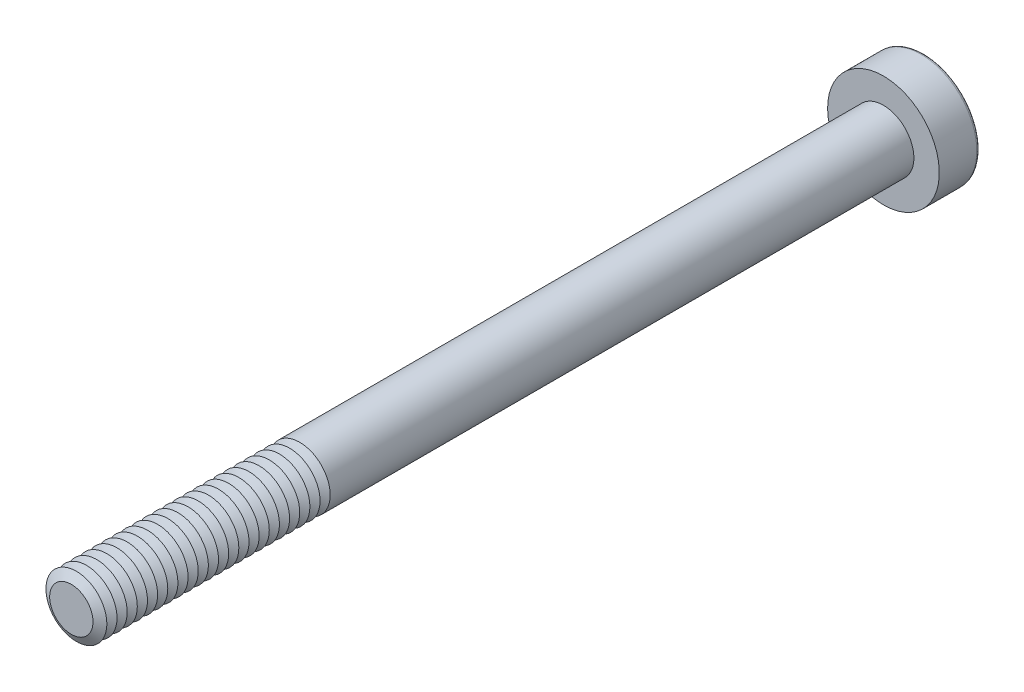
ISO-10303-21;
HEADER;
FILE_DESCRIPTION(('STEP AP214'),'2;1');
FILE_NAME('part.step','',(''),(''),'','','');
FILE_SCHEMA(('AUTOMOTIVE_DESIGN { 1 0 10303 214 1 1 1 1 }'));
ENDSEC;
DATA;
#1=APPLICATION_CONTEXT('core data for automotive mechanical design processes');
#2=APPLICATION_PROTOCOL_DEFINITION('international standard','automotive_design',2000,#1);
#3=PRODUCT_CONTEXT('',#1,'mechanical');
#4=PRODUCT('Part','Part','',(#3));
#5=PRODUCT_RELATED_PRODUCT_CATEGORY('part','',(#4));
#6=PRODUCT_DEFINITION_FORMATION('','',#4);
#7=PRODUCT_DEFINITION_CONTEXT('part definition',#1,'design');
#8=PRODUCT_DEFINITION('design','',#6,#7);
#9=PRODUCT_DEFINITION_SHAPE('','',#8);
#10=(LENGTH_UNIT() NAMED_UNIT(*) SI_UNIT(.MILLI.,.METRE.));
#11=(NAMED_UNIT(*) PLANE_ANGLE_UNIT() SI_UNIT($,.RADIAN.));
#12=(NAMED_UNIT(*) SI_UNIT($,.STERADIAN.) SOLID_ANGLE_UNIT());
#13=UNCERTAINTY_MEASURE_WITH_UNIT(LENGTH_MEASURE(1.E-05),#10,'distance_accuracy_value','');
#14=(GEOMETRIC_REPRESENTATION_CONTEXT(3) GLOBAL_UNCERTAINTY_ASSIGNED_CONTEXT((#13)) GLOBAL_UNIT_ASSIGNED_CONTEXT((#10,
#11,#12)) REPRESENTATION_CONTEXT('',''));
#15=CARTESIAN_POINT('',(0.,0.,0.));
#16=DIRECTION('',(0.,0.,1.));
#17=DIRECTION('',(1.,0.,0.));
#18=AXIS2_PLACEMENT_3D('',#15,#16,#17);
#19=CARTESIAN_POINT('',(0.,0.,38.25));
#20=DIRECTION('',(0.,0.,1.));
#21=DIRECTION('',(1.,0.,0.));
#22=AXIS2_PLACEMENT_3D('',#19,#20,#21);
#23=CONICAL_SURFACE('',#22,1.5,1.0471975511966);
#24=CARTESIAN_POINT('',(0.,0.,38.));
#25=DIRECTION('',(0.,0.,1.));
#26=DIRECTION('',(1.,0.,0.));
#27=AXIS2_PLACEMENT_3D('',#24,#25,#26);
#28=CIRCLE('',#27,1.06698729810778);
#29=CARTESIAN_POINT('',(1.06698729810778,0.,38.));
#30=VERTEX_POINT('',#29);
#31=EDGE_CURVE('E313',#30,#30,#28,.T.);
#32=ORIENTED_EDGE('',*,*,#31,.T.);
#33=EDGE_LOOP('',(#32));
#34=FACE_BOUND('',#33,.T.);
#35=CARTESIAN_POINT('',(0.,0.,38.25));
#36=DIRECTION('',(0.,0.,1.));
#37=DIRECTION('',(1.,0.,0.));
#38=AXIS2_PLACEMENT_3D('',#35,#36,#37);
#39=CIRCLE('',#38,1.5);
#40=CARTESIAN_POINT('',(1.5,0.,38.25));
#41=VERTEX_POINT('',#40);
#42=EDGE_CURVE('E316',#41,#41,#39,.T.);
#43=ORIENTED_EDGE('',*,*,#42,.F.);
#44=EDGE_LOOP('',(#43));
#45=FACE_BOUND('',#44,.T.);
#46=ADVANCED_FACE('F39',(#34,#45),#23,.T.);
#47=CARTESIAN_POINT('',(0.,0.,38.));
#48=DIRECTION('',(0.,0.,-1.));
#49=DIRECTION('',(-1.,0.,0.));
#50=AXIS2_PLACEMENT_3D('',#47,#48,#49);
#51=CONICAL_SURFACE('',#50,1.06698729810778,1.0471975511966);
#52=CARTESIAN_POINT('',(0.,0.,37.75));
#53=DIRECTION('',(0.,0.,1.));
#54=DIRECTION('',(1.,0.,0.));
#55=AXIS2_PLACEMENT_3D('',#52,#53,#54);
#56=CIRCLE('',#55,1.5);
#57=CARTESIAN_POINT('',(1.5,0.,37.75));
#58=VERTEX_POINT('',#57);
#59=EDGE_CURVE('E324',#58,#58,#56,.T.);
#60=ORIENTED_EDGE('',*,*,#59,.T.);
#61=EDGE_LOOP('',(#60));
#62=FACE_BOUND('',#61,.T.);
#63=ORIENTED_EDGE('',*,*,#31,.F.);
#64=EDGE_LOOP('',(#63));
#65=FACE_BOUND('',#64,.T.);
#66=ADVANCED_FACE('F245',(#62,#65),#51,.T.);
#67=CARTESIAN_POINT('',(0.,0.,40.));
#68=DIRECTION('',(0.,0.,1.));
#69=DIRECTION('',(1.,0.,0.));
#70=AXIS2_PLACEMENT_3D('',#67,#68,#69);
#71=PLANE('',#70);
#72=CARTESIAN_POINT('',(0.,0.,40.));
#73=DIRECTION('',(0.,0.,1.));
#74=DIRECTION('',(1.,0.,0.));
#75=AXIS2_PLACEMENT_3D('',#72,#73,#74);
#76=CIRCLE('',#75,1.06698729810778);
#77=CARTESIAN_POINT('',(1.06698729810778,0.,40.));
#78=VERTEX_POINT('',#77);
#79=EDGE_CURVE('E174',#78,#78,#76,.T.);
#80=ORIENTED_EDGE('',*,*,#79,.T.);
#81=EDGE_LOOP('',(#80));
#82=FACE_BOUND('',#81,.T.);
#83=ADVANCED_FACE('F251',(#82),#71,.T.);
#84=CARTESIAN_POINT('',(0.,0.,40.));
#85=DIRECTION('',(0.,0.,-1.));
#86=DIRECTION('',(-1.,0.,0.));
#87=AXIS2_PLACEMENT_3D('',#84,#85,#86);
#88=CONICAL_SURFACE('',#87,1.06698729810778,1.0471975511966);
#89=CARTESIAN_POINT('',(0.,0.,39.75));
#90=DIRECTION('',(0.,0.,1.));
#91=DIRECTION('',(1.,0.,0.));
#92=AXIS2_PLACEMENT_3D('',#89,#90,#91);
#93=CIRCLE('',#92,1.5);
#94=CARTESIAN_POINT('',(1.5,0.,39.75));
#95=VERTEX_POINT('',#94);
#96=EDGE_CURVE('E291',#95,#95,#93,.T.);
#97=ORIENTED_EDGE('',*,*,#96,.T.);
#98=EDGE_LOOP('',(#97));
#99=FACE_BOUND('',#98,.T.);
#100=ORIENTED_EDGE('',*,*,#79,.F.);
#101=EDGE_LOOP('',(#100));
#102=FACE_BOUND('',#101,.T.);
#103=ADVANCED_FACE('F199',(#99,#102),#88,.T.);
#104=CARTESIAN_POINT('',(0.,0.,39.75));
#105=DIRECTION('',(0.,0.,1.));
#106=DIRECTION('',(1.,0.,0.));
#107=AXIS2_PLACEMENT_3D('',#104,#105,#106);
#108=CONICAL_SURFACE('',#107,1.5,1.0471975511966);
#109=CARTESIAN_POINT('',(0.,0.,39.5));
#110=DIRECTION('',(0.,0.,1.));
#111=DIRECTION('',(1.,0.,0.));
#112=AXIS2_PLACEMENT_3D('',#109,#110,#111);
#113=CIRCLE('',#112,1.06698729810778);
#114=CARTESIAN_POINT('',(1.06698729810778,0.,39.5));
#115=VERTEX_POINT('',#114);
#116=EDGE_CURVE('E288',#115,#115,#113,.T.);
#117=ORIENTED_EDGE('',*,*,#116,.T.);
#118=EDGE_LOOP('',(#117));
#119=FACE_BOUND('',#118,.T.);
#120=ORIENTED_EDGE('',*,*,#96,.F.);
#121=EDGE_LOOP('',(#120));
#122=FACE_BOUND('',#121,.T.);
#123=ADVANCED_FACE('F277',(#119,#122),#108,.T.);
#124=CARTESIAN_POINT('',(0.,0.,39.5));
#125=DIRECTION('',(0.,0.,-1.));
#126=DIRECTION('',(-1.,0.,0.));
#127=AXIS2_PLACEMENT_3D('',#124,#125,#126);
#128=CONICAL_SURFACE('',#127,1.06698729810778,1.0471975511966);
#129=CARTESIAN_POINT('',(0.,0.,39.25));
#130=DIRECTION('',(0.,0.,1.));
#131=DIRECTION('',(1.,0.,0.));
#132=AXIS2_PLACEMENT_3D('',#129,#130,#131);
#133=CIRCLE('',#132,1.5);
#134=CARTESIAN_POINT('',(1.5,0.,39.25));
#135=VERTEX_POINT('',#134);
#136=EDGE_CURVE('E300',#135,#135,#133,.T.);
#137=ORIENTED_EDGE('',*,*,#136,.T.);
#138=EDGE_LOOP('',(#137));
#139=FACE_BOUND('',#138,.T.);
#140=ORIENTED_EDGE('',*,*,#116,.F.);
#141=EDGE_LOOP('',(#140));
#142=FACE_BOUND('',#141,.T.);
#143=ADVANCED_FACE('F274',(#139,#142),#128,.T.);
#144=CARTESIAN_POINT('',(0.,0.,39.25));
#145=DIRECTION('',(0.,0.,1.));
#146=DIRECTION('',(1.,0.,0.));
#147=AXIS2_PLACEMENT_3D('',#144,#145,#146);
#148=CONICAL_SURFACE('',#147,1.5,1.0471975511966);
#149=CARTESIAN_POINT('',(0.,0.,39.));
#150=DIRECTION('',(0.,0.,1.));
#151=DIRECTION('',(1.,0.,0.));
#152=AXIS2_PLACEMENT_3D('',#149,#150,#151);
#153=CIRCLE('',#152,1.06698729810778);
#154=CARTESIAN_POINT('',(1.06698729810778,0.,39.));
#155=VERTEX_POINT('',#154);
#156=EDGE_CURVE('E293',#155,#155,#153,.T.);
#157=ORIENTED_EDGE('',*,*,#156,.T.);
#158=EDGE_LOOP('',(#157));
#159=FACE_BOUND('',#158,.T.);
#160=ORIENTED_EDGE('',*,*,#136,.F.);
#161=EDGE_LOOP('',(#160));
#162=FACE_BOUND('',#161,.T.);
#163=ADVANCED_FACE('F270',(#159,#162),#148,.T.);
#164=CARTESIAN_POINT('',(0.,0.,39.));
#165=DIRECTION('',(0.,0.,-1.));
#166=DIRECTION('',(-1.,0.,0.));
#167=AXIS2_PLACEMENT_3D('',#164,#165,#166);
#168=CONICAL_SURFACE('',#167,1.06698729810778,1.0471975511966);
#169=CARTESIAN_POINT('',(0.,0.,38.75));
#170=DIRECTION('',(0.,0.,1.));
#171=DIRECTION('',(1.,0.,0.));
#172=AXIS2_PLACEMENT_3D('',#169,#170,#171);
#173=CIRCLE('',#172,1.5);
#174=CARTESIAN_POINT('',(1.5,0.,38.75));
#175=VERTEX_POINT('',#174);
#176=EDGE_CURVE('E309',#175,#175,#173,.T.);
#177=ORIENTED_EDGE('',*,*,#176,.T.);
#178=EDGE_LOOP('',(#177));
#179=FACE_BOUND('',#178,.T.);
#180=ORIENTED_EDGE('',*,*,#156,.F.);
#181=EDGE_LOOP('',(#180));
#182=FACE_BOUND('',#181,.T.);
#183=ADVANCED_FACE('F266',(#179,#182),#168,.T.);
#184=CARTESIAN_POINT('',(0.,0.,38.75));
#185=DIRECTION('',(0.,0.,1.));
#186=DIRECTION('',(1.,0.,0.));
#187=AXIS2_PLACEMENT_3D('',#184,#185,#186);
#188=CONICAL_SURFACE('',#187,1.5,1.0471975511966);
#189=CARTESIAN_POINT('',(0.,0.,38.5));
#190=DIRECTION('',(0.,0.,1.));
#191=DIRECTION('',(1.,0.,0.));
#192=AXIS2_PLACEMENT_3D('',#189,#190,#191);
#193=CIRCLE('',#192,1.06698729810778);
#194=CARTESIAN_POINT('',(1.06698729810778,0.,38.5));
#195=VERTEX_POINT('',#194);
#196=EDGE_CURVE('E305',#195,#195,#193,.T.);
#197=ORIENTED_EDGE('',*,*,#196,.T.);
#198=EDGE_LOOP('',(#197));
#199=FACE_BOUND('',#198,.T.);
#200=ORIENTED_EDGE('',*,*,#176,.F.);
#201=EDGE_LOOP('',(#200));
#202=FACE_BOUND('',#201,.T.);
#203=ADVANCED_FACE('F262',(#199,#202),#188,.T.);
#204=CARTESIAN_POINT('',(0.,0.,38.5));
#205=DIRECTION('',(0.,0.,-1.));
#206=DIRECTION('',(-1.,0.,0.));
#207=AXIS2_PLACEMENT_3D('',#204,#205,#206);
#208=CONICAL_SURFACE('',#207,1.06698729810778,1.0471975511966);
#209=ORIENTED_EDGE('',*,*,#42,.T.);
#210=EDGE_LOOP('',(#209));
#211=FACE_BOUND('',#210,.T.);
#212=ORIENTED_EDGE('',*,*,#196,.F.);
#213=EDGE_LOOP('',(#212));
#214=FACE_BOUND('',#213,.T.);
#215=ADVANCED_FACE('F258',(#211,#214),#208,.T.);
#216=CARTESIAN_POINT('',(0.,0.,37.75));
#217=DIRECTION('',(0.,0.,1.));
#218=DIRECTION('',(1.,0.,0.));
#219=AXIS2_PLACEMENT_3D('',#216,#217,#218);
#220=CONICAL_SURFACE('',#219,1.5,1.0471975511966);
#221=CARTESIAN_POINT('',(0.,0.,37.5));
#222=DIRECTION('',(0.,0.,1.));
#223=DIRECTION('',(1.,0.,0.));
#224=AXIS2_PLACEMENT_3D('',#221,#222,#223);
#225=CIRCLE('',#224,1.06698729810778);
#226=CARTESIAN_POINT('',(1.06698729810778,0.,37.5));
#227=VERTEX_POINT('',#226);
#228=EDGE_CURVE('E320',#227,#227,#225,.T.);
#229=ORIENTED_EDGE('',*,*,#228,.T.);
#230=EDGE_LOOP('',(#229));
#231=FACE_BOUND('',#230,.T.);
#232=ORIENTED_EDGE('',*,*,#59,.F.);
#233=EDGE_LOOP('',(#232));
#234=FACE_BOUND('',#233,.T.);
#235=ADVANCED_FACE('F261',(#231,#234),#220,.T.);
#236=CARTESIAN_POINT('',(0.,0.,37.5));
#237=DIRECTION('',(0.,0.,-1.));
#238=DIRECTION('',(-1.,0.,0.));
#239=AXIS2_PLACEMENT_3D('',#236,#237,#238);
#240=CONICAL_SURFACE('',#239,1.06698729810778,1.0471975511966);
#241=CARTESIAN_POINT('',(0.,0.,37.25));
#242=DIRECTION('',(0.,0.,1.));
#243=DIRECTION('',(1.,0.,0.));
#244=AXIS2_PLACEMENT_3D('',#241,#242,#243);
#245=CIRCLE('',#244,1.5);
#246=CARTESIAN_POINT('',(1.5,0.,37.25));
#247=VERTEX_POINT('',#246);
#248=EDGE_CURVE('E332',#247,#247,#245,.T.);
#249=ORIENTED_EDGE('',*,*,#248,.T.);
#250=EDGE_LOOP('',(#249));
#251=FACE_BOUND('',#250,.T.);
#252=ORIENTED_EDGE('',*,*,#228,.F.);
#253=EDGE_LOOP('',(#252));
#254=FACE_BOUND('',#253,.T.);
#255=ADVANCED_FACE('F609',(#251,#254),#240,.T.);
#256=CARTESIAN_POINT('',(0.,0.,37.25));
#257=DIRECTION('',(0.,0.,1.));
#258=DIRECTION('',(1.,0.,0.));
#259=AXIS2_PLACEMENT_3D('',#256,#257,#258);
#260=CONICAL_SURFACE('',#259,1.5,1.0471975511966);
#261=CARTESIAN_POINT('',(0.,0.,37.));
#262=DIRECTION('',(0.,0.,1.));
#263=DIRECTION('',(1.,0.,0.));
#264=AXIS2_PLACEMENT_3D('',#261,#262,#263);
#265=CIRCLE('',#264,1.06698729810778);
#266=CARTESIAN_POINT('',(1.06698729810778,0.,37.));
#267=VERTEX_POINT('',#266);
#268=EDGE_CURVE('E328',#267,#267,#265,.T.);
#269=ORIENTED_EDGE('',*,*,#268,.T.);
#270=EDGE_LOOP('',(#269));
#271=FACE_BOUND('',#270,.T.);
#272=ORIENTED_EDGE('',*,*,#248,.F.);
#273=EDGE_LOOP('',(#272));
#274=FACE_BOUND('',#273,.T.);
#275=ADVANCED_FACE('F605',(#271,#274),#260,.T.);
#276=CARTESIAN_POINT('',(0.,0.,37.));
#277=DIRECTION('',(0.,0.,-1.));
#278=DIRECTION('',(-1.,0.,0.));
#279=AXIS2_PLACEMENT_3D('',#276,#277,#278);
#280=CONICAL_SURFACE('',#279,1.06698729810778,1.0471975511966);
#281=CARTESIAN_POINT('',(0.,0.,36.75));
#282=DIRECTION('',(0.,0.,1.));
#283=DIRECTION('',(1.,0.,0.));
#284=AXIS2_PLACEMENT_3D('',#281,#282,#283);
#285=CIRCLE('',#284,1.5);
#286=CARTESIAN_POINT('',(1.5,0.,36.75));
#287=VERTEX_POINT('',#286);
#288=EDGE_CURVE('E340',#287,#287,#285,.T.);
#289=ORIENTED_EDGE('',*,*,#288,.T.);
#290=EDGE_LOOP('',(#289));
#291=FACE_BOUND('',#290,.T.);
#292=ORIENTED_EDGE('',*,*,#268,.F.);
#293=EDGE_LOOP('',(#292));
#294=FACE_BOUND('',#293,.T.);
#295=ADVANCED_FACE('F601',(#291,#294),#280,.T.);
#296=CARTESIAN_POINT('',(0.,0.,36.75));
#297=DIRECTION('',(0.,0.,1.));
#298=DIRECTION('',(1.,0.,0.));
#299=AXIS2_PLACEMENT_3D('',#296,#297,#298);
#300=CONICAL_SURFACE('',#299,1.5,1.0471975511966);
#301=CARTESIAN_POINT('',(0.,0.,36.5));
#302=DIRECTION('',(0.,0.,1.));
#303=DIRECTION('',(1.,0.,0.));
#304=AXIS2_PLACEMENT_3D('',#301,#302,#303);
#305=CIRCLE('',#304,1.06698729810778);
#306=CARTESIAN_POINT('',(1.06698729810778,0.,36.5));
#307=VERTEX_POINT('',#306);
#308=EDGE_CURVE('E336',#307,#307,#305,.T.);
#309=ORIENTED_EDGE('',*,*,#308,.T.);
#310=EDGE_LOOP('',(#309));
#311=FACE_BOUND('',#310,.T.);
#312=ORIENTED_EDGE('',*,*,#288,.F.);
#313=EDGE_LOOP('',(#312));
#314=FACE_BOUND('',#313,.T.);
#315=ADVANCED_FACE('F597',(#311,#314),#300,.T.);
#316=CARTESIAN_POINT('',(0.,0.,36.5));
#317=DIRECTION('',(0.,0.,-1.));
#318=DIRECTION('',(-1.,0.,0.));
#319=AXIS2_PLACEMENT_3D('',#316,#317,#318);
#320=CONICAL_SURFACE('',#319,1.06698729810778,1.0471975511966);
#321=CARTESIAN_POINT('',(0.,0.,36.25));
#322=DIRECTION('',(0.,0.,1.));
#323=DIRECTION('',(1.,0.,0.));
#324=AXIS2_PLACEMENT_3D('',#321,#322,#323);
#325=CIRCLE('',#324,1.5);
#326=CARTESIAN_POINT('',(1.5,0.,36.25));
#327=VERTEX_POINT('',#326);
#328=EDGE_CURVE('E348',#327,#327,#325,.T.);
#329=ORIENTED_EDGE('',*,*,#328,.T.);
#330=EDGE_LOOP('',(#329));
#331=FACE_BOUND('',#330,.T.);
#332=ORIENTED_EDGE('',*,*,#308,.F.);
#333=EDGE_LOOP('',(#332));
#334=FACE_BOUND('',#333,.T.);
#335=ADVANCED_FACE('F593',(#331,#334),#320,.T.);
#336=CARTESIAN_POINT('',(0.,0.,36.25));
#337=DIRECTION('',(0.,0.,1.));
#338=DIRECTION('',(1.,0.,0.));
#339=AXIS2_PLACEMENT_3D('',#336,#337,#338);
#340=CONICAL_SURFACE('',#339,1.5,1.0471975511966);
#341=CARTESIAN_POINT('',(0.,0.,36.));
#342=DIRECTION('',(0.,0.,1.));
#343=DIRECTION('',(1.,0.,0.));
#344=AXIS2_PLACEMENT_3D('',#341,#342,#343);
#345=CIRCLE('',#344,1.06698729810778);
#346=CARTESIAN_POINT('',(1.06698729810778,0.,36.));
#347=VERTEX_POINT('',#346);
#348=EDGE_CURVE('E344',#347,#347,#345,.T.);
#349=ORIENTED_EDGE('',*,*,#348,.T.);
#350=EDGE_LOOP('',(#349));
#351=FACE_BOUND('',#350,.T.);
#352=ORIENTED_EDGE('',*,*,#328,.F.);
#353=EDGE_LOOP('',(#352));
#354=FACE_BOUND('',#353,.T.);
#355=ADVANCED_FACE('F589',(#351,#354),#340,.T.);
#356=CARTESIAN_POINT('',(0.,0.,36.));
#357=DIRECTION('',(0.,0.,-1.));
#358=DIRECTION('',(-1.,0.,0.));
#359=AXIS2_PLACEMENT_3D('',#356,#357,#358);
#360=CONICAL_SURFACE('',#359,1.06698729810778,1.0471975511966);
#361=CARTESIAN_POINT('',(0.,0.,35.75));
#362=DIRECTION('',(0.,0.,1.));
#363=DIRECTION('',(1.,0.,0.));
#364=AXIS2_PLACEMENT_3D('',#361,#362,#363);
#365=CIRCLE('',#364,1.5);
#366=CARTESIAN_POINT('',(1.5,0.,35.75));
#367=VERTEX_POINT('',#366);
#368=EDGE_CURVE('E356',#367,#367,#365,.T.);
#369=ORIENTED_EDGE('',*,*,#368,.T.);
#370=EDGE_LOOP('',(#369));
#371=FACE_BOUND('',#370,.T.);
#372=ORIENTED_EDGE('',*,*,#348,.F.);
#373=EDGE_LOOP('',(#372));
#374=FACE_BOUND('',#373,.T.);
#375=ADVANCED_FACE('F585',(#371,#374),#360,.T.);
#376=CARTESIAN_POINT('',(0.,0.,35.75));
#377=DIRECTION('',(0.,0.,1.));
#378=DIRECTION('',(1.,0.,0.));
#379=AXIS2_PLACEMENT_3D('',#376,#377,#378);
#380=CONICAL_SURFACE('',#379,1.5,1.0471975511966);
#381=CARTESIAN_POINT('',(0.,0.,35.5));
#382=DIRECTION('',(0.,0.,1.));
#383=DIRECTION('',(1.,0.,0.));
#384=AXIS2_PLACEMENT_3D('',#381,#382,#383);
#385=CIRCLE('',#384,1.06698729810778);
#386=CARTESIAN_POINT('',(1.06698729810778,0.,35.5));
#387=VERTEX_POINT('',#386);
#388=EDGE_CURVE('E352',#387,#387,#385,.T.);
#389=ORIENTED_EDGE('',*,*,#388,.T.);
#390=EDGE_LOOP('',(#389));
#391=FACE_BOUND('',#390,.T.);
#392=ORIENTED_EDGE('',*,*,#368,.F.);
#393=EDGE_LOOP('',(#392));
#394=FACE_BOUND('',#393,.T.);
#395=ADVANCED_FACE('F581',(#391,#394),#380,.T.);
#396=CARTESIAN_POINT('',(0.,0.,35.5));
#397=DIRECTION('',(0.,0.,-1.));
#398=DIRECTION('',(-1.,0.,0.));
#399=AXIS2_PLACEMENT_3D('',#396,#397,#398);
#400=CONICAL_SURFACE('',#399,1.06698729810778,1.0471975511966);
#401=CARTESIAN_POINT('',(0.,0.,35.25));
#402=DIRECTION('',(0.,0.,1.));
#403=DIRECTION('',(1.,0.,0.));
#404=AXIS2_PLACEMENT_3D('',#401,#402,#403);
#405=CIRCLE('',#404,1.5);
#406=CARTESIAN_POINT('',(1.5,0.,35.25));
#407=VERTEX_POINT('',#406);
#408=EDGE_CURVE('E364',#407,#407,#405,.T.);
#409=ORIENTED_EDGE('',*,*,#408,.T.);
#410=EDGE_LOOP('',(#409));
#411=FACE_BOUND('',#410,.T.);
#412=ORIENTED_EDGE('',*,*,#388,.F.);
#413=EDGE_LOOP('',(#412));
#414=FACE_BOUND('',#413,.T.);
#415=ADVANCED_FACE('F577',(#411,#414),#400,.T.);
#416=CARTESIAN_POINT('',(0.,0.,35.25));
#417=DIRECTION('',(0.,0.,1.));
#418=DIRECTION('',(1.,0.,0.));
#419=AXIS2_PLACEMENT_3D('',#416,#417,#418);
#420=CONICAL_SURFACE('',#419,1.5,1.0471975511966);
#421=CARTESIAN_POINT('',(0.,0.,35.));
#422=DIRECTION('',(0.,0.,1.));
#423=DIRECTION('',(1.,0.,0.));
#424=AXIS2_PLACEMENT_3D('',#421,#422,#423);
#425=CIRCLE('',#424,1.06698729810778);
#426=CARTESIAN_POINT('',(1.06698729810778,0.,35.));
#427=VERTEX_POINT('',#426);
#428=EDGE_CURVE('E360',#427,#427,#425,.T.);
#429=ORIENTED_EDGE('',*,*,#428,.T.);
#430=EDGE_LOOP('',(#429));
#431=FACE_BOUND('',#430,.T.);
#432=ORIENTED_EDGE('',*,*,#408,.F.);
#433=EDGE_LOOP('',(#432));
#434=FACE_BOUND('',#433,.T.);
#435=ADVANCED_FACE('F573',(#431,#434),#420,.T.);
#436=CARTESIAN_POINT('',(0.,0.,35.));
#437=DIRECTION('',(0.,0.,-1.));
#438=DIRECTION('',(-1.,0.,0.));
#439=AXIS2_PLACEMENT_3D('',#436,#437,#438);
#440=CONICAL_SURFACE('',#439,1.06698729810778,1.0471975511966);
#441=CARTESIAN_POINT('',(0.,0.,34.75));
#442=DIRECTION('',(0.,0.,1.));
#443=DIRECTION('',(1.,0.,0.));
#444=AXIS2_PLACEMENT_3D('',#441,#442,#443);
#445=CIRCLE('',#444,1.5);
#446=CARTESIAN_POINT('',(1.5,0.,34.75));
#447=VERTEX_POINT('',#446);
#448=EDGE_CURVE('E372',#447,#447,#445,.T.);
#449=ORIENTED_EDGE('',*,*,#448,.T.);
#450=EDGE_LOOP('',(#449));
#451=FACE_BOUND('',#450,.T.);
#452=ORIENTED_EDGE('',*,*,#428,.F.);
#453=EDGE_LOOP('',(#452));
#454=FACE_BOUND('',#453,.T.);
#455=ADVANCED_FACE('F569',(#451,#454),#440,.T.);
#456=CARTESIAN_POINT('',(0.,0.,34.75));
#457=DIRECTION('',(0.,0.,1.));
#458=DIRECTION('',(1.,0.,0.));
#459=AXIS2_PLACEMENT_3D('',#456,#457,#458);
#460=CONICAL_SURFACE('',#459,1.5,1.0471975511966);
#461=CARTESIAN_POINT('',(0.,0.,34.5));
#462=DIRECTION('',(0.,0.,1.));
#463=DIRECTION('',(1.,0.,0.));
#464=AXIS2_PLACEMENT_3D('',#461,#462,#463);
#465=CIRCLE('',#464,1.06698729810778);
#466=CARTESIAN_POINT('',(1.06698729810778,0.,34.5));
#467=VERTEX_POINT('',#466);
#468=EDGE_CURVE('E368',#467,#467,#465,.T.);
#469=ORIENTED_EDGE('',*,*,#468,.T.);
#470=EDGE_LOOP('',(#469));
#471=FACE_BOUND('',#470,.T.);
#472=ORIENTED_EDGE('',*,*,#448,.F.);
#473=EDGE_LOOP('',(#472));
#474=FACE_BOUND('',#473,.T.);
#475=ADVANCED_FACE('F565',(#471,#474),#460,.T.);
#476=CARTESIAN_POINT('',(0.,0.,34.5));
#477=DIRECTION('',(0.,0.,-1.));
#478=DIRECTION('',(-1.,0.,0.));
#479=AXIS2_PLACEMENT_3D('',#476,#477,#478);
#480=CONICAL_SURFACE('',#479,1.06698729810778,1.0471975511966);
#481=CARTESIAN_POINT('',(0.,0.,34.25));
#482=DIRECTION('',(0.,0.,1.));
#483=DIRECTION('',(1.,0.,0.));
#484=AXIS2_PLACEMENT_3D('',#481,#482,#483);
#485=CIRCLE('',#484,1.5);
#486=CARTESIAN_POINT('',(1.5,0.,34.25));
#487=VERTEX_POINT('',#486);
#488=EDGE_CURVE('E380',#487,#487,#485,.T.);
#489=ORIENTED_EDGE('',*,*,#488,.T.);
#490=EDGE_LOOP('',(#489));
#491=FACE_BOUND('',#490,.T.);
#492=ORIENTED_EDGE('',*,*,#468,.F.);
#493=EDGE_LOOP('',(#492));
#494=FACE_BOUND('',#493,.T.);
#495=ADVANCED_FACE('F561',(#491,#494),#480,.T.);
#496=CARTESIAN_POINT('',(0.,0.,34.25));
#497=DIRECTION('',(0.,0.,1.));
#498=DIRECTION('',(1.,0.,0.));
#499=AXIS2_PLACEMENT_3D('',#496,#497,#498);
#500=CONICAL_SURFACE('',#499,1.5,1.0471975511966);
#501=CARTESIAN_POINT('',(0.,0.,34.));
#502=DIRECTION('',(0.,0.,1.));
#503=DIRECTION('',(1.,0.,0.));
#504=AXIS2_PLACEMENT_3D('',#501,#502,#503);
#505=CIRCLE('',#504,1.06698729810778);
#506=CARTESIAN_POINT('',(1.06698729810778,0.,34.));
#507=VERTEX_POINT('',#506);
#508=EDGE_CURVE('E376',#507,#507,#505,.T.);
#509=ORIENTED_EDGE('',*,*,#508,.T.);
#510=EDGE_LOOP('',(#509));
#511=FACE_BOUND('',#510,.T.);
#512=ORIENTED_EDGE('',*,*,#488,.F.);
#513=EDGE_LOOP('',(#512));
#514=FACE_BOUND('',#513,.T.);
#515=ADVANCED_FACE('F557',(#511,#514),#500,.T.);
#516=CARTESIAN_POINT('',(0.,0.,34.));
#517=DIRECTION('',(0.,0.,-1.));
#518=DIRECTION('',(-1.,0.,0.));
#519=AXIS2_PLACEMENT_3D('',#516,#517,#518);
#520=CONICAL_SURFACE('',#519,1.06698729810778,1.0471975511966);
#521=CARTESIAN_POINT('',(0.,0.,33.75));
#522=DIRECTION('',(0.,0.,1.));
#523=DIRECTION('',(1.,0.,0.));
#524=AXIS2_PLACEMENT_3D('',#521,#522,#523);
#525=CIRCLE('',#524,1.5);
#526=CARTESIAN_POINT('',(1.5,0.,33.75));
#527=VERTEX_POINT('',#526);
#528=EDGE_CURVE('E388',#527,#527,#525,.T.);
#529=ORIENTED_EDGE('',*,*,#528,.T.);
#530=EDGE_LOOP('',(#529));
#531=FACE_BOUND('',#530,.T.);
#532=ORIENTED_EDGE('',*,*,#508,.F.);
#533=EDGE_LOOP('',(#532));
#534=FACE_BOUND('',#533,.T.);
#535=ADVANCED_FACE('F553',(#531,#534),#520,.T.);
#536=CARTESIAN_POINT('',(0.,0.,33.75));
#537=DIRECTION('',(0.,0.,1.));
#538=DIRECTION('',(1.,0.,0.));
#539=AXIS2_PLACEMENT_3D('',#536,#537,#538);
#540=CONICAL_SURFACE('',#539,1.5,1.0471975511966);
#541=CARTESIAN_POINT('',(0.,0.,33.5));
#542=DIRECTION('',(0.,0.,1.));
#543=DIRECTION('',(1.,0.,0.));
#544=AXIS2_PLACEMENT_3D('',#541,#542,#543);
#545=CIRCLE('',#544,1.06698729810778);
#546=CARTESIAN_POINT('',(1.06698729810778,0.,33.5));
#547=VERTEX_POINT('',#546);
#548=EDGE_CURVE('E384',#547,#547,#545,.T.);
#549=ORIENTED_EDGE('',*,*,#548,.T.);
#550=EDGE_LOOP('',(#549));
#551=FACE_BOUND('',#550,.T.);
#552=ORIENTED_EDGE('',*,*,#528,.F.);
#553=EDGE_LOOP('',(#552));
#554=FACE_BOUND('',#553,.T.);
#555=ADVANCED_FACE('F549',(#551,#554),#540,.T.);
#556=CARTESIAN_POINT('',(0.,0.,33.5));
#557=DIRECTION('',(0.,0.,-1.));
#558=DIRECTION('',(-1.,0.,0.));
#559=AXIS2_PLACEMENT_3D('',#556,#557,#558);
#560=CONICAL_SURFACE('',#559,1.06698729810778,1.0471975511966);
#561=CARTESIAN_POINT('',(0.,0.,33.25));
#562=DIRECTION('',(0.,0.,1.));
#563=DIRECTION('',(1.,0.,0.));
#564=AXIS2_PLACEMENT_3D('',#561,#562,#563);
#565=CIRCLE('',#564,1.5);
#566=CARTESIAN_POINT('',(1.5,0.,33.25));
#567=VERTEX_POINT('',#566);
#568=EDGE_CURVE('E396',#567,#567,#565,.T.);
#569=ORIENTED_EDGE('',*,*,#568,.T.);
#570=EDGE_LOOP('',(#569));
#571=FACE_BOUND('',#570,.T.);
#572=ORIENTED_EDGE('',*,*,#548,.F.);
#573=EDGE_LOOP('',(#572));
#574=FACE_BOUND('',#573,.T.);
#575=ADVANCED_FACE('F545',(#571,#574),#560,.T.);
#576=CARTESIAN_POINT('',(0.,0.,33.25));
#577=DIRECTION('',(0.,0.,1.));
#578=DIRECTION('',(1.,0.,0.));
#579=AXIS2_PLACEMENT_3D('',#576,#577,#578);
#580=CONICAL_SURFACE('',#579,1.5,1.0471975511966);
#581=CARTESIAN_POINT('',(0.,0.,33.));
#582=DIRECTION('',(0.,0.,1.));
#583=DIRECTION('',(1.,0.,0.));
#584=AXIS2_PLACEMENT_3D('',#581,#582,#583);
#585=CIRCLE('',#584,1.06698729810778);
#586=CARTESIAN_POINT('',(1.06698729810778,0.,33.));
#587=VERTEX_POINT('',#586);
#588=EDGE_CURVE('E392',#587,#587,#585,.T.);
#589=ORIENTED_EDGE('',*,*,#588,.T.);
#590=EDGE_LOOP('',(#589));
#591=FACE_BOUND('',#590,.T.);
#592=ORIENTED_EDGE('',*,*,#568,.F.);
#593=EDGE_LOOP('',(#592));
#594=FACE_BOUND('',#593,.T.);
#595=ADVANCED_FACE('F541',(#591,#594),#580,.T.);
#596=CARTESIAN_POINT('',(0.,0.,33.));
#597=DIRECTION('',(0.,0.,-1.));
#598=DIRECTION('',(-1.,0.,0.));
#599=AXIS2_PLACEMENT_3D('',#596,#597,#598);
#600=CONICAL_SURFACE('',#599,1.06698729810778,1.0471975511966);
#601=CARTESIAN_POINT('',(0.,0.,32.75));
#602=DIRECTION('',(0.,0.,1.));
#603=DIRECTION('',(1.,0.,0.));
#604=AXIS2_PLACEMENT_3D('',#601,#602,#603);
#605=CIRCLE('',#604,1.5);
#606=CARTESIAN_POINT('',(1.5,0.,32.75));
#607=VERTEX_POINT('',#606);
#608=EDGE_CURVE('E404',#607,#607,#605,.T.);
#609=ORIENTED_EDGE('',*,*,#608,.T.);
#610=EDGE_LOOP('',(#609));
#611=FACE_BOUND('',#610,.T.);
#612=ORIENTED_EDGE('',*,*,#588,.F.);
#613=EDGE_LOOP('',(#612));
#614=FACE_BOUND('',#613,.T.);
#615=ADVANCED_FACE('F537',(#611,#614),#600,.T.);
#616=CARTESIAN_POINT('',(0.,0.,32.75));
#617=DIRECTION('',(0.,0.,1.));
#618=DIRECTION('',(1.,0.,0.));
#619=AXIS2_PLACEMENT_3D('',#616,#617,#618);
#620=CONICAL_SURFACE('',#619,1.5,1.0471975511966);
#621=CARTESIAN_POINT('',(0.,0.,32.5));
#622=DIRECTION('',(0.,0.,1.));
#623=DIRECTION('',(1.,0.,0.));
#624=AXIS2_PLACEMENT_3D('',#621,#622,#623);
#625=CIRCLE('',#624,1.06698729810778);
#626=CARTESIAN_POINT('',(1.06698729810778,0.,32.5));
#627=VERTEX_POINT('',#626);
#628=EDGE_CURVE('E400',#627,#627,#625,.T.);
#629=ORIENTED_EDGE('',*,*,#628,.T.);
#630=EDGE_LOOP('',(#629));
#631=FACE_BOUND('',#630,.T.);
#632=ORIENTED_EDGE('',*,*,#608,.F.);
#633=EDGE_LOOP('',(#632));
#634=FACE_BOUND('',#633,.T.);
#635=ADVANCED_FACE('F533',(#631,#634),#620,.T.);
#636=CARTESIAN_POINT('',(0.,0.,32.5));
#637=DIRECTION('',(0.,0.,-1.));
#638=DIRECTION('',(-1.,0.,0.));
#639=AXIS2_PLACEMENT_3D('',#636,#637,#638);
#640=CONICAL_SURFACE('',#639,1.06698729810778,1.0471975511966);
#641=CARTESIAN_POINT('',(0.,0.,32.25));
#642=DIRECTION('',(0.,0.,1.));
#643=DIRECTION('',(1.,0.,0.));
#644=AXIS2_PLACEMENT_3D('',#641,#642,#643);
#645=CIRCLE('',#644,1.5);
#646=CARTESIAN_POINT('',(1.5,0.,32.25));
#647=VERTEX_POINT('',#646);
#648=EDGE_CURVE('E412',#647,#647,#645,.T.);
#649=ORIENTED_EDGE('',*,*,#648,.T.);
#650=EDGE_LOOP('',(#649));
#651=FACE_BOUND('',#650,.T.);
#652=ORIENTED_EDGE('',*,*,#628,.F.);
#653=EDGE_LOOP('',(#652));
#654=FACE_BOUND('',#653,.T.);
#655=ADVANCED_FACE('F529',(#651,#654),#640,.T.);
#656=CARTESIAN_POINT('',(0.,0.,32.25));
#657=DIRECTION('',(0.,0.,1.));
#658=DIRECTION('',(1.,0.,0.));
#659=AXIS2_PLACEMENT_3D('',#656,#657,#658);
#660=CONICAL_SURFACE('',#659,1.5,1.0471975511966);
#661=CARTESIAN_POINT('',(0.,0.,32.));
#662=DIRECTION('',(0.,0.,1.));
#663=DIRECTION('',(1.,0.,0.));
#664=AXIS2_PLACEMENT_3D('',#661,#662,#663);
#665=CIRCLE('',#664,1.06698729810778);
#666=CARTESIAN_POINT('',(1.06698729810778,0.,32.));
#667=VERTEX_POINT('',#666);
#668=EDGE_CURVE('E408',#667,#667,#665,.T.);
#669=ORIENTED_EDGE('',*,*,#668,.T.);
#670=EDGE_LOOP('',(#669));
#671=FACE_BOUND('',#670,.T.);
#672=ORIENTED_EDGE('',*,*,#648,.F.);
#673=EDGE_LOOP('',(#672));
#674=FACE_BOUND('',#673,.T.);
#675=ADVANCED_FACE('F525',(#671,#674),#660,.T.);
#676=CARTESIAN_POINT('',(0.,0.,32.));
#677=DIRECTION('',(0.,0.,-1.));
#678=DIRECTION('',(-1.,0.,0.));
#679=AXIS2_PLACEMENT_3D('',#676,#677,#678);
#680=CONICAL_SURFACE('',#679,1.06698729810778,1.0471975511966);
#681=CARTESIAN_POINT('',(0.,0.,31.75));
#682=DIRECTION('',(0.,0.,1.));
#683=DIRECTION('',(1.,0.,0.));
#684=AXIS2_PLACEMENT_3D('',#681,#682,#683);
#685=CIRCLE('',#684,1.5);
#686=CARTESIAN_POINT('',(1.5,0.,31.75));
#687=VERTEX_POINT('',#686);
#688=EDGE_CURVE('E420',#687,#687,#685,.T.);
#689=ORIENTED_EDGE('',*,*,#688,.T.);
#690=EDGE_LOOP('',(#689));
#691=FACE_BOUND('',#690,.T.);
#692=ORIENTED_EDGE('',*,*,#668,.F.);
#693=EDGE_LOOP('',(#692));
#694=FACE_BOUND('',#693,.T.);
#695=ADVANCED_FACE('F521',(#691,#694),#680,.T.);
#696=CARTESIAN_POINT('',(0.,0.,31.75));
#697=DIRECTION('',(0.,0.,1.));
#698=DIRECTION('',(1.,0.,0.));
#699=AXIS2_PLACEMENT_3D('',#696,#697,#698);
#700=CONICAL_SURFACE('',#699,1.5,1.0471975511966);
#701=CARTESIAN_POINT('',(0.,0.,31.5));
#702=DIRECTION('',(0.,0.,1.));
#703=DIRECTION('',(1.,0.,0.));
#704=AXIS2_PLACEMENT_3D('',#701,#702,#703);
#705=CIRCLE('',#704,1.06698729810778);
#706=CARTESIAN_POINT('',(1.06698729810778,0.,31.5));
#707=VERTEX_POINT('',#706);
#708=EDGE_CURVE('E416',#707,#707,#705,.T.);
#709=ORIENTED_EDGE('',*,*,#708,.T.);
#710=EDGE_LOOP('',(#709));
#711=FACE_BOUND('',#710,.T.);
#712=ORIENTED_EDGE('',*,*,#688,.F.);
#713=EDGE_LOOP('',(#712));
#714=FACE_BOUND('',#713,.T.);
#715=ADVANCED_FACE('F517',(#711,#714),#700,.T.);
#716=CARTESIAN_POINT('',(0.,0.,31.5));
#717=DIRECTION('',(0.,0.,-1.));
#718=DIRECTION('',(-1.,0.,0.));
#719=AXIS2_PLACEMENT_3D('',#716,#717,#718);
#720=CONICAL_SURFACE('',#719,1.06698729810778,1.0471975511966);
#721=CARTESIAN_POINT('',(0.,0.,31.25));
#722=DIRECTION('',(0.,0.,1.));
#723=DIRECTION('',(1.,0.,0.));
#724=AXIS2_PLACEMENT_3D('',#721,#722,#723);
#725=CIRCLE('',#724,1.5);
#726=CARTESIAN_POINT('',(1.5,0.,31.25));
#727=VERTEX_POINT('',#726);
#728=EDGE_CURVE('E428',#727,#727,#725,.T.);
#729=ORIENTED_EDGE('',*,*,#728,.T.);
#730=EDGE_LOOP('',(#729));
#731=FACE_BOUND('',#730,.T.);
#732=ORIENTED_EDGE('',*,*,#708,.F.);
#733=EDGE_LOOP('',(#732));
#734=FACE_BOUND('',#733,.T.);
#735=ADVANCED_FACE('F513',(#731,#734),#720,.T.);
#736=CARTESIAN_POINT('',(0.,0.,31.25));
#737=DIRECTION('',(0.,0.,1.));
#738=DIRECTION('',(1.,0.,0.));
#739=AXIS2_PLACEMENT_3D('',#736,#737,#738);
#740=CONICAL_SURFACE('',#739,1.5,1.0471975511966);
#741=CARTESIAN_POINT('',(0.,0.,31.));
#742=DIRECTION('',(0.,0.,1.));
#743=DIRECTION('',(1.,0.,0.));
#744=AXIS2_PLACEMENT_3D('',#741,#742,#743);
#745=CIRCLE('',#744,1.06698729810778);
#746=CARTESIAN_POINT('',(1.06698729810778,0.,31.));
#747=VERTEX_POINT('',#746);
#748=EDGE_CURVE('E424',#747,#747,#745,.T.);
#749=ORIENTED_EDGE('',*,*,#748,.T.);
#750=EDGE_LOOP('',(#749));
#751=FACE_BOUND('',#750,.T.);
#752=ORIENTED_EDGE('',*,*,#728,.F.);
#753=EDGE_LOOP('',(#752));
#754=FACE_BOUND('',#753,.T.);
#755=ADVANCED_FACE('F509',(#751,#754),#740,.T.);
#756=CARTESIAN_POINT('',(0.,0.,31.));
#757=DIRECTION('',(0.,0.,-1.));
#758=DIRECTION('',(-1.,0.,0.));
#759=AXIS2_PLACEMENT_3D('',#756,#757,#758);
#760=CONICAL_SURFACE('',#759,1.06698729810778,1.0471975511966);
#761=CARTESIAN_POINT('',(0.,0.,30.75));
#762=DIRECTION('',(0.,0.,1.));
#763=DIRECTION('',(1.,0.,0.));
#764=AXIS2_PLACEMENT_3D('',#761,#762,#763);
#765=CIRCLE('',#764,1.5);
#766=CARTESIAN_POINT('',(1.5,0.,30.75));
#767=VERTEX_POINT('',#766);
#768=EDGE_CURVE('E436',#767,#767,#765,.T.);
#769=ORIENTED_EDGE('',*,*,#768,.T.);
#770=EDGE_LOOP('',(#769));
#771=FACE_BOUND('',#770,.T.);
#772=ORIENTED_EDGE('',*,*,#748,.F.);
#773=EDGE_LOOP('',(#772));
#774=FACE_BOUND('',#773,.T.);
#775=ADVANCED_FACE('F505',(#771,#774),#760,.T.);
#776=CARTESIAN_POINT('',(0.,0.,30.75));
#777=DIRECTION('',(0.,0.,1.));
#778=DIRECTION('',(1.,0.,0.));
#779=AXIS2_PLACEMENT_3D('',#776,#777,#778);
#780=CONICAL_SURFACE('',#779,1.5,1.0471975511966);
#781=CARTESIAN_POINT('',(0.,0.,30.5));
#782=DIRECTION('',(0.,0.,1.));
#783=DIRECTION('',(1.,0.,0.));
#784=AXIS2_PLACEMENT_3D('',#781,#782,#783);
#785=CIRCLE('',#784,1.06698729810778);
#786=CARTESIAN_POINT('',(1.06698729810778,0.,30.5));
#787=VERTEX_POINT('',#786);
#788=EDGE_CURVE('E432',#787,#787,#785,.T.);
#789=ORIENTED_EDGE('',*,*,#788,.T.);
#790=EDGE_LOOP('',(#789));
#791=FACE_BOUND('',#790,.T.);
#792=ORIENTED_EDGE('',*,*,#768,.F.);
#793=EDGE_LOOP('',(#792));
#794=FACE_BOUND('',#793,.T.);
#795=ADVANCED_FACE('F501',(#791,#794),#780,.T.);
#796=CARTESIAN_POINT('',(0.,0.,30.5));
#797=DIRECTION('',(0.,0.,-1.));
#798=DIRECTION('',(-1.,0.,0.));
#799=AXIS2_PLACEMENT_3D('',#796,#797,#798);
#800=CONICAL_SURFACE('',#799,1.06698729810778,1.0471975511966);
#801=CARTESIAN_POINT('',(0.,0.,30.25));
#802=DIRECTION('',(0.,0.,1.));
#803=DIRECTION('',(1.,0.,0.));
#804=AXIS2_PLACEMENT_3D('',#801,#802,#803);
#805=CIRCLE('',#804,1.5);
#806=CARTESIAN_POINT('',(1.5,0.,30.25));
#807=VERTEX_POINT('',#806);
#808=EDGE_CURVE('E444',#807,#807,#805,.T.);
#809=ORIENTED_EDGE('',*,*,#808,.T.);
#810=EDGE_LOOP('',(#809));
#811=FACE_BOUND('',#810,.T.);
#812=ORIENTED_EDGE('',*,*,#788,.F.);
#813=EDGE_LOOP('',(#812));
#814=FACE_BOUND('',#813,.T.);
#815=ADVANCED_FACE('F497',(#811,#814),#800,.T.);
#816=CARTESIAN_POINT('',(0.,0.,30.25));
#817=DIRECTION('',(0.,0.,1.));
#818=DIRECTION('',(1.,0.,0.));
#819=AXIS2_PLACEMENT_3D('',#816,#817,#818);
#820=CONICAL_SURFACE('',#819,1.5,1.0471975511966);
#821=CARTESIAN_POINT('',(0.,0.,30.));
#822=DIRECTION('',(0.,0.,1.));
#823=DIRECTION('',(1.,0.,0.));
#824=AXIS2_PLACEMENT_3D('',#821,#822,#823);
#825=CIRCLE('',#824,1.06698729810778);
#826=CARTESIAN_POINT('',(1.06698729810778,0.,30.));
#827=VERTEX_POINT('',#826);
#828=EDGE_CURVE('E440',#827,#827,#825,.T.);
#829=ORIENTED_EDGE('',*,*,#828,.T.);
#830=EDGE_LOOP('',(#829));
#831=FACE_BOUND('',#830,.T.);
#832=ORIENTED_EDGE('',*,*,#808,.F.);
#833=EDGE_LOOP('',(#832));
#834=FACE_BOUND('',#833,.T.);
#835=ADVANCED_FACE('F493',(#831,#834),#820,.T.);
#836=CARTESIAN_POINT('',(0.,0.,30.));
#837=DIRECTION('',(0.,0.,-1.));
#838=DIRECTION('',(-1.,0.,0.));
#839=AXIS2_PLACEMENT_3D('',#836,#837,#838);
#840=CONICAL_SURFACE('',#839,1.06698729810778,1.0471975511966);
#841=CARTESIAN_POINT('',(0.,0.,29.75));
#842=DIRECTION('',(0.,0.,1.));
#843=DIRECTION('',(1.,0.,0.));
#844=AXIS2_PLACEMENT_3D('',#841,#842,#843);
#845=CIRCLE('',#844,1.5);
#846=CARTESIAN_POINT('',(1.5,0.,29.75));
#847=VERTEX_POINT('',#846);
#848=EDGE_CURVE('E452',#847,#847,#845,.T.);
#849=ORIENTED_EDGE('',*,*,#848,.T.);
#850=EDGE_LOOP('',(#849));
#851=FACE_BOUND('',#850,.T.);
#852=ORIENTED_EDGE('',*,*,#828,.F.);
#853=EDGE_LOOP('',(#852));
#854=FACE_BOUND('',#853,.T.);
#855=ADVANCED_FACE('F489',(#851,#854),#840,.T.);
#856=CARTESIAN_POINT('',(0.,0.,29.75));
#857=DIRECTION('',(0.,0.,1.));
#858=DIRECTION('',(1.,0.,0.));
#859=AXIS2_PLACEMENT_3D('',#856,#857,#858);
#860=CONICAL_SURFACE('',#859,1.5,1.0471975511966);
#861=CARTESIAN_POINT('',(0.,0.,29.5));
#862=DIRECTION('',(0.,0.,1.));
#863=DIRECTION('',(1.,0.,0.));
#864=AXIS2_PLACEMENT_3D('',#861,#862,#863);
#865=CIRCLE('',#864,1.06698729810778);
#866=CARTESIAN_POINT('',(1.06698729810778,0.,29.5));
#867=VERTEX_POINT('',#866);
#868=EDGE_CURVE('E448',#867,#867,#865,.T.);
#869=ORIENTED_EDGE('',*,*,#868,.T.);
#870=EDGE_LOOP('',(#869));
#871=FACE_BOUND('',#870,.T.);
#872=ORIENTED_EDGE('',*,*,#848,.F.);
#873=EDGE_LOOP('',(#872));
#874=FACE_BOUND('',#873,.T.);
#875=ADVANCED_FACE('F484',(#871,#874),#860,.T.);
#876=CARTESIAN_POINT('',(0.,0.,29.5));
#877=DIRECTION('',(0.,0.,-1.));
#878=DIRECTION('',(-1.,0.,0.));
#879=AXIS2_PLACEMENT_3D('',#876,#877,#878);
#880=CONICAL_SURFACE('',#879,1.06698729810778,1.0471975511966);
#881=CARTESIAN_POINT('',(0.,0.,29.25));
#882=DIRECTION('',(0.,0.,1.));
#883=DIRECTION('',(1.,0.,0.));
#884=AXIS2_PLACEMENT_3D('',#881,#882,#883);
#885=CIRCLE('',#884,1.5);
#886=CARTESIAN_POINT('',(1.5,0.,29.25));
#887=VERTEX_POINT('',#886);
#888=EDGE_CURVE('E464',#887,#887,#885,.T.);
#889=ORIENTED_EDGE('',*,*,#888,.T.);
#890=EDGE_LOOP('',(#889));
#891=FACE_BOUND('',#890,.T.);
#892=ORIENTED_EDGE('',*,*,#868,.F.);
#893=EDGE_LOOP('',(#892));
#894=FACE_BOUND('',#893,.T.);
#895=ADVANCED_FACE('F470',(#891,#894),#880,.T.);
#896=CARTESIAN_POINT('',(0.,0.,29.25));
#897=DIRECTION('',(0.,0.,1.));
#898=DIRECTION('',(1.,0.,0.));
#899=AXIS2_PLACEMENT_3D('',#896,#897,#898);
#900=CONICAL_SURFACE('',#899,1.5,1.0471975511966);
#901=CARTESIAN_POINT('',(0.,0.,29.));
#902=DIRECTION('',(0.,0.,1.));
#903=DIRECTION('',(1.,0.,0.));
#904=AXIS2_PLACEMENT_3D('',#901,#902,#903);
#905=CIRCLE('',#904,1.06698729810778);
#906=CARTESIAN_POINT('',(1.06698729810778,0.,29.));
#907=VERTEX_POINT('',#906);
#908=EDGE_CURVE('E456',#907,#907,#905,.T.);
#909=ORIENTED_EDGE('',*,*,#908,.T.);
#910=EDGE_LOOP('',(#909));
#911=FACE_BOUND('',#910,.T.);
#912=ORIENTED_EDGE('',*,*,#888,.F.);
#913=EDGE_LOOP('',(#912));
#914=FACE_BOUND('',#913,.T.);
#915=ADVANCED_FACE('F473',(#911,#914),#900,.T.);
#916=CARTESIAN_POINT('',(0.,0.,29.));
#917=DIRECTION('',(0.,0.,-1.));
#918=DIRECTION('',(-1.,0.,0.));
#919=AXIS2_PLACEMENT_3D('',#916,#917,#918);
#920=CONICAL_SURFACE('',#919,1.06698729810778,1.0471975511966);
#921=CARTESIAN_POINT('',(0.,0.,28.75));
#922=DIRECTION('',(0.,0.,1.));
#923=DIRECTION('',(1.,0.,0.));
#924=AXIS2_PLACEMENT_3D('',#921,#922,#923);
#925=CIRCLE('',#924,1.5);
#926=CARTESIAN_POINT('',(1.5,0.,28.75));
#927=VERTEX_POINT('',#926);
#928=EDGE_CURVE('E460',#927,#927,#925,.T.);
#929=ORIENTED_EDGE('',*,*,#928,.T.);
#930=EDGE_LOOP('',(#929));
#931=FACE_BOUND('',#930,.T.);
#932=ORIENTED_EDGE('',*,*,#908,.F.);
#933=EDGE_LOOP('',(#932));
#934=FACE_BOUND('',#933,.T.);
#935=ADVANCED_FACE('F475',(#931,#934),#920,.T.);
#936=CARTESIAN_POINT('',(0.,0.,-0.5));
#937=DIRECTION('',(0.,0.,-1.));
#938=DIRECTION('',(-1.,0.,0.));
#939=AXIS2_PLACEMENT_3D('',#936,#937,#938);
#940=CONICAL_SURFACE('',#939,0.999999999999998,1.0471975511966);
#941=CARTESIAN_POINT('',(0.,0.,0.0773502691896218));
#942=VERTEX_POINT('',#941);
#943=VERTEX_LOOP('',#942);
#944=FACE_BOUND('',#943,.T.);
#945=CARTESIAN_POINT('',(0.,0.,-0.5));
#946=DIRECTION('',(0.,0.,-1.));
#947=DIRECTION('',(-1.,0.,0.));
#948=AXIS2_PLACEMENT_3D('',#945,#946,#947);
#949=CIRCLE('',#948,0.999999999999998);
#950=CARTESIAN_POINT('',(-0.866025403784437,0.499999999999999,-0.5));
#951=VERTEX_POINT('',#950);
#952=CARTESIAN_POINT('',(0.,0.999999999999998,-0.5));
#953=VERTEX_POINT('',#952);
#954=EDGE_CURVE('E149',#951,#953,#949,.T.);
#955=ORIENTED_EDGE('',*,*,#954,.T.);
#956=CARTESIAN_POINT('',(0.,0.,-0.5));
#957=DIRECTION('',(0.,0.,-1.));
#958=DIRECTION('',(-1.,0.,0.));
#959=AXIS2_PLACEMENT_3D('',#956,#957,#958);
#960=CIRCLE('',#959,0.999999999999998);
#961=CARTESIAN_POINT('',(0.866025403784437,0.499999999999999,-0.5));
#962=VERTEX_POINT('',#961);
#963=EDGE_CURVE('E54',#953,#962,#960,.T.);
#964=ORIENTED_EDGE('',*,*,#963,.T.);
#965=CARTESIAN_POINT('',(0.866025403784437,-0.499999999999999,-0.5));
#966=VERTEX_POINT('',#965);
#967=EDGE_CURVE('E1208',#962,#966,#960,.T.);
#968=ORIENTED_EDGE('',*,*,#967,.T.);
#969=CARTESIAN_POINT('',(0.,-0.999999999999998,-0.5));
#970=VERTEX_POINT('',#969);
#971=EDGE_CURVE('E1207',#966,#970,#960,.T.);
#972=ORIENTED_EDGE('',*,*,#971,.T.);
#973=CARTESIAN_POINT('',(-0.866025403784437,-0.499999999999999,-0.5));
#974=VERTEX_POINT('',#973);
#975=EDGE_CURVE('E1200',#970,#974,#960,.T.);
#976=ORIENTED_EDGE('',*,*,#975,.T.);
#977=EDGE_CURVE('E1198',#974,#951,#960,.T.);
#978=ORIENTED_EDGE('',*,*,#977,.T.);
#979=EDGE_LOOP('',(#955,#964,#968,#972,#976,#978));
#980=FACE_BOUND('',#979,.T.);
#981=ADVANCED_FACE('F201',(#944,#980),#940,.F.);
#982=CARTESIAN_POINT('',(0.,0.,-0.5));
#983=DIRECTION('',(0.,0.,-1.));
#984=DIRECTION('',(-1.,0.,0.));
#985=AXIS2_PLACEMENT_3D('',#982,#983,#984);
#986=PLANE('',#985);
#987=ORIENTED_EDGE('',*,*,#963,.F.);
#988=DIRECTION('',(1.,0.,0.));
#989=VECTOR('',#988,1.);
#990=CARTESIAN_POINT('',(-0.577350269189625,1.,-0.5));
#991=LINE('',#990,#989);
#992=CARTESIAN_POINT('',(0.577350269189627,1.,-0.5));
#993=VERTEX_POINT('',#992);
#994=EDGE_CURVE('E1251',#953,#993,#991,.T.);
#995=ORIENTED_EDGE('',*,*,#994,.T.);
#996=DIRECTION('',(0.5,-0.866025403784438,0.));
#997=VECTOR('',#996,1.);
#998=CARTESIAN_POINT('',(0.577350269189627,1.,-0.5));
#999=LINE('',#998,#997);
#1000=EDGE_CURVE('E155',#993,#962,#999,.T.);
#1001=ORIENTED_EDGE('',*,*,#1000,.T.);
#1002=EDGE_LOOP('',(#987,#995,#1001));
#1003=FACE_BOUND('',#1002,.T.);
#1004=ADVANCED_FACE('F740',(#1003),#986,.T.);
#1005=ORIENTED_EDGE('',*,*,#967,.F.);
#1006=CARTESIAN_POINT('',(1.15470053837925,0.,-0.5));
#1007=VERTEX_POINT('',#1006);
#1008=EDGE_CURVE('E1245',#962,#1007,#999,.T.);
#1009=ORIENTED_EDGE('',*,*,#1008,.T.);
#1010=DIRECTION('',(-0.5,-0.866025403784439,0.));
#1011=VECTOR('',#1010,1.);
#1012=CARTESIAN_POINT('',(1.15470053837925,0.,-0.5));
#1013=LINE('',#1012,#1011);
#1014=EDGE_CURVE('E1221',#1007,#966,#1013,.T.);
#1015=ORIENTED_EDGE('',*,*,#1014,.T.);
#1016=EDGE_LOOP('',(#1005,#1009,#1015));
#1017=FACE_BOUND('',#1016,.T.);
#1018=ADVANCED_FACE('F750',(#1017),#986,.T.);
#1019=ORIENTED_EDGE('',*,*,#971,.F.);
#1020=CARTESIAN_POINT('',(0.577350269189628,-1.,-0.5));
#1021=VERTEX_POINT('',#1020);
#1022=EDGE_CURVE('E1223',#966,#1021,#1013,.T.);
#1023=ORIENTED_EDGE('',*,*,#1022,.T.);
#1024=DIRECTION('',(-1.,0.,0.));
#1025=VECTOR('',#1024,1.);
#1026=CARTESIAN_POINT('',(0.577350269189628,-1.,-0.5));
#1027=LINE('',#1026,#1025);
#1028=EDGE_CURVE('E1173',#1021,#970,#1027,.T.);
#1029=ORIENTED_EDGE('',*,*,#1028,.T.);
#1030=EDGE_LOOP('',(#1019,#1023,#1029));
#1031=FACE_BOUND('',#1030,.T.);
#1032=ADVANCED_FACE('F760',(#1031),#986,.T.);
#1033=ORIENTED_EDGE('',*,*,#975,.F.);
#1034=CARTESIAN_POINT('',(-0.577350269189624,-0.999999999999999,-0.5));
#1035=VERTEX_POINT('',#1034);
#1036=EDGE_CURVE('E1217',#970,#1035,#1027,.T.);
#1037=ORIENTED_EDGE('',*,*,#1036,.T.);
#1038=DIRECTION('',(-0.5,0.866025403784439,0.));
#1039=VECTOR('',#1038,1.);
#1040=CARTESIAN_POINT('',(-0.577350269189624,-0.999999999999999,-0.5));
#1041=LINE('',#1040,#1039);
#1042=EDGE_CURVE('E1219',#1035,#974,#1041,.T.);
#1043=ORIENTED_EDGE('',*,*,#1042,.T.);
#1044=EDGE_LOOP('',(#1033,#1037,#1043));
#1045=FACE_BOUND('',#1044,.T.);
#1046=ADVANCED_FACE('F768',(#1045),#986,.T.);
#1047=ORIENTED_EDGE('',*,*,#977,.F.);
#1048=CARTESIAN_POINT('',(-1.15470053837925,0.,-0.5));
#1049=VERTEX_POINT('',#1048);
#1050=EDGE_CURVE('E1225',#974,#1049,#1041,.T.);
#1051=ORIENTED_EDGE('',*,*,#1050,.T.);
#1052=DIRECTION('',(0.5,0.866025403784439,0.));
#1053=VECTOR('',#1052,1.);
#1054=CARTESIAN_POINT('',(-1.15470053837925,0.,-0.5));
#1055=LINE('',#1054,#1053);
#1056=EDGE_CURVE('E158',#1049,#951,#1055,.T.);
#1057=ORIENTED_EDGE('',*,*,#1056,.T.);
#1058=EDGE_LOOP('',(#1047,#1051,#1057));
#1059=FACE_BOUND('',#1058,.T.);
#1060=ADVANCED_FACE('F231',(#1059),#986,.T.);
#1061=ORIENTED_EDGE('',*,*,#954,.F.);
#1062=CARTESIAN_POINT('',(-0.577350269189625,1.,-0.5));
#1063=VERTEX_POINT('',#1062);
#1064=EDGE_CURVE('E1233',#951,#1063,#1055,.T.);
#1065=ORIENTED_EDGE('',*,*,#1064,.T.);
#1066=EDGE_CURVE('E1246',#1063,#953,#991,.T.);
#1067=ORIENTED_EDGE('',*,*,#1066,.T.);
#1068=EDGE_LOOP('',(#1061,#1065,#1067));
#1069=FACE_BOUND('',#1068,.T.);
#1070=ADVANCED_FACE('F752',(#1069),#986,.T.);
#1071=CARTESIAN_POINT('',(-0.577350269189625,1.,-0.5));
#1072=DIRECTION('',(0.,1.,0.));
#1073=DIRECTION('',(0.,0.,1.));
#1074=AXIS2_PLACEMENT_3D('',#1071,#1072,#1073);
#1075=PLANE('',#1074);
#1076=DIRECTION('',(0.,0.,-1.));
#1077=VECTOR('',#1076,1.);
#1078=CARTESIAN_POINT('',(-0.577350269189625,1.,-0.5));
#1079=LINE('',#1078,#1077);
#1080=CARTESIAN_POINT('',(-0.577350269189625,1.,-2.));
#1081=VERTEX_POINT('',#1080);
#1082=EDGE_CURVE('E147',#1063,#1081,#1079,.T.);
#1083=ORIENTED_EDGE('',*,*,#1082,.T.);
#1084=CARTESIAN_POINT('',(-1.50720379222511,1.,-2.17525844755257));
#1085=CARTESIAN_POINT('',(-1.46204888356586,1.,-2.16517814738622));
#1086=CARTESIAN_POINT('',(-1.41686530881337,1.,-2.15522625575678));
#1087=CARTESIAN_POINT('',(-1.32642642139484,1.,-2.13564428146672));
#1088=CARTESIAN_POINT('',(-1.28117110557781,1.,-2.12601421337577));
#1089=CARTESIAN_POINT('',(-1.14519006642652,1.,-2.09768643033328));
#1090=CARTESIAN_POINT('',(-1.05434091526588,1.,-2.07957187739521));
#1091=CARTESIAN_POINT('',(-0.87298578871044,1.,-2.04585879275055));
#1092=CARTESIAN_POINT('',(-0.782483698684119,1.,-2.03023975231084));
#1093=CARTESIAN_POINT('',(-0.600935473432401,1.,-2.00256781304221));
#1094=CARTESIAN_POINT('',(-0.509889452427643,1.,-1.99051419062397));
#1095=CARTESIAN_POINT('',(-0.326198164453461,1.,-1.9715245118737));
#1096=CARTESIAN_POINT('',(-0.233546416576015,1.,-1.96464740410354));
#1097=CARTESIAN_POINT('',(-0.0480110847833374,1.,-1.95773316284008));
#1098=CARTESIAN_POINT('',(0.0448723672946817,1.,-1.95769276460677));
#1099=CARTESIAN_POINT('',(0.230753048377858,1.,-1.96446847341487));
#1100=CARTESIAN_POINT('',(0.323749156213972,1.,-1.97131296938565));
#1101=CARTESIAN_POINT('',(0.509217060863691,1.,-1.99040362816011));
#1102=CARTESIAN_POINT('',(0.601688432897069,1.,-2.00265366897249));
#1103=CARTESIAN_POINT('',(0.788469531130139,1.,-2.0311825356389));
#1104=CARTESIAN_POINT('',(0.882763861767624,1.,-2.04755860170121));
#1105=CARTESIAN_POINT('',(1.07089474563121,1.,-2.08278522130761));
#1106=CARTESIAN_POINT('',(1.16473122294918,1.,-2.1016361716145));
#1107=CARTESIAN_POINT('',(1.35209202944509,1.,-2.14094224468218));
#1108=CARTESIAN_POINT('',(1.44561626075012,1.,-2.16139782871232));
#1109=CARTESIAN_POINT('',(1.63242626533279,1.,-2.20337233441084));
#1110=CARTESIAN_POINT('',(1.72571203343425,1.,-2.22489127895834));
#1111=CARTESIAN_POINT('',(1.91097396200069,1.,-2.26839206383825));
#1112=CARTESIAN_POINT('',(2.00295221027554,1.,-2.29036504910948));
#1113=CARTESIAN_POINT('',(2.18678775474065,1.,-2.3348190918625));
#1114=CARTESIAN_POINT('',(2.27864504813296,1.,-2.35730016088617));
#1115=CARTESIAN_POINT('',(2.46214009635,1.,-2.40260092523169));
#1116=CARTESIAN_POINT('',(2.55377797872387,1.,-2.42542010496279));
#1117=CARTESIAN_POINT('',(2.73697957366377,1.,-2.47134052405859));
#1118=CARTESIAN_POINT('',(2.82854328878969,1.,-2.49444175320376));
#1119=CARTESIAN_POINT('',(2.92008180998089,1.,-2.51764127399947));
#1120=B_SPLINE_CURVE_WITH_KNOTS('',3,(#1084,#1085,#1086,#1087,#1088,#1089,#1090,#1091,#1092,
#1093,#1094,#1095,#1096,#1097,#1098,#1099,#1100,#1101,#1102,#1103,#1104,#1105,#1106,#1107,#1108,
#1109,#1110,#1111,#1112,#1113,#1114,#1115,#1116,#1117,#1118,#1119),.UNSPECIFIED.,.F.,.F.,(4,2,2,
2,2,2,2,2,2,2,2,2,2,2,2,2,2,4),(0.,0.138798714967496,0.277603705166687,0.555495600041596,
0.830971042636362,1.106390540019,1.38490086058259,1.66327818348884,1.94280808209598,
2.22253884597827,2.50960639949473,2.79672003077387,3.08391650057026,3.37111915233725,
3.65481652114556,3.93852034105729,4.22182877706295,4.50512697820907),.UNSPECIFIED.);
#1121=CARTESIAN_POINT('',(0.577350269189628,0.999999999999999,-2.));
#1122=VERTEX_POINT('',#1121);
#1123=EDGE_CURVE('E124',#1081,#1122,#1120,.T.);
#1124=ORIENTED_EDGE('',*,*,#1123,.T.);
#1125=DIRECTION('',(0.,0.,-1.));
#1126=VECTOR('',#1125,1.);
#1127=CARTESIAN_POINT('',(0.577350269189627,1.,-0.5));
#1128=LINE('',#1127,#1126);
#1129=EDGE_CURVE('E143',#993,#1122,#1128,.T.);
#1130=ORIENTED_EDGE('',*,*,#1129,.F.);
#1131=ORIENTED_EDGE('',*,*,#994,.F.);
#1132=ORIENTED_EDGE('',*,*,#1066,.F.);
#1133=EDGE_LOOP('',(#1083,#1124,#1130,#1131,#1132));
#1134=FACE_BOUND('',#1133,.T.);
#1135=ADVANCED_FACE('F141',(#1134),#1075,.F.);
#1136=CARTESIAN_POINT('',(0.577350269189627,1.,-0.5));
#1137=DIRECTION('',(0.866025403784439,0.5,0.));
#1138=DIRECTION('',(-0.5,0.866025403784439,0.));
#1139=AXIS2_PLACEMENT_3D('',#1136,#1137,#1138);
#1140=PLANE('',#1139);
#1141=ORIENTED_EDGE('',*,*,#1129,.T.);
#1142=CARTESIAN_POINT('',(0.577234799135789,1.0002,-2.00003094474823));
#1143=CARTESIAN_POINT('',(0.601220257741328,0.958655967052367,-1.99359970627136));
#1144=CARTESIAN_POINT('',(0.625249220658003,0.917036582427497,-1.98776108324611));
#1145=CARTESIAN_POINT('',(0.673392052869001,0.833650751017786,-1.97750302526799));
#1146=CARTESIAN_POINT('',(0.697505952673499,0.79188425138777,-1.97308416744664));
#1147=CARTESIAN_POINT('',(0.745672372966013,0.70845756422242,-1.96592373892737));
#1148=CARTESIAN_POINT('',(0.769724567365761,0.666797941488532,-1.96317362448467));
#1149=CARTESIAN_POINT('',(0.817859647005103,0.583425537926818,-1.95948598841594));
#1150=CARTESIAN_POINT('',(0.841942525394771,0.541712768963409,-1.95854811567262));
#1151=CARTESIAN_POINT('',(0.890108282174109,0.458287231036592,-1.95854811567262));
#1152=CARTESIAN_POINT('',(0.914191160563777,0.416574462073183,-1.95948598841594));
#1153=CARTESIAN_POINT('',(0.962326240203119,0.33320205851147,-1.96317362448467));
#1154=CARTESIAN_POINT('',(0.986378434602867,0.291542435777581,-1.96592373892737));
#1155=CARTESIAN_POINT('',(1.03454485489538,0.208115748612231,-1.97308416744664));
#1156=CARTESIAN_POINT('',(1.05865875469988,0.166349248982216,-1.97750302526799));
#1157=CARTESIAN_POINT('',(1.10680158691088,0.0829634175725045,-1.98776108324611));
#1158=CARTESIAN_POINT('',(1.13083054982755,0.0413440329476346,-1.99359970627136));
#1159=CARTESIAN_POINT('',(1.15481600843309,-0.000199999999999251,-2.00003094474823));
#1160=B_SPLINE_CURVE_WITH_KNOTS('',3,(#1142,#1143,#1144,#1145,#1146,#1147,#1148,#1149,#1150,
#1151,#1152,#1153,#1154,#1155,#1156,#1157,#1158,#1159),.UNSPECIFIED.,.F.,.F.,(4,2,2,2,2,2,2,2,
4),(0.,0.145207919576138,0.290474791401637,0.434991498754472,0.579480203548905,
0.723968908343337,0.868485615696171,1.01375248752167,1.15896040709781),.UNSPECIFIED.);
#1161=CARTESIAN_POINT('',(1.15470053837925,0.,-2.));
#1162=VERTEX_POINT('',#1161);
#1163=EDGE_CURVE('E11',#1122,#1162,#1160,.T.);
#1164=ORIENTED_EDGE('',*,*,#1163,.T.);
#1165=DIRECTION('',(0.,0.,-1.));
#1166=VECTOR('',#1165,1.);
#1167=CARTESIAN_POINT('',(1.15470053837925,0.,-0.5));
#1168=LINE('',#1167,#1166);
#1169=EDGE_CURVE('E157',#1007,#1162,#1168,.T.);
#1170=ORIENTED_EDGE('',*,*,#1169,.F.);
#1171=ORIENTED_EDGE('',*,*,#1008,.F.);
#1172=ORIENTED_EDGE('',*,*,#1000,.F.);
#1173=EDGE_LOOP('',(#1141,#1164,#1170,#1171,#1172));
#1174=FACE_BOUND('',#1173,.T.);
#1175=ADVANCED_FACE('F152',(#1174),#1140,.F.);
#1176=CARTESIAN_POINT('',(1.15470053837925,0.,-0.5));
#1177=DIRECTION('',(0.866025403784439,-0.5,0.));
#1178=DIRECTION('',(0.5,0.866025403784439,0.));
#1179=AXIS2_PLACEMENT_3D('',#1176,#1177,#1178);
#1180=PLANE('',#1179);
#1181=ORIENTED_EDGE('',*,*,#1169,.T.);
#1182=CARTESIAN_POINT('',(1.15481600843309,0.000200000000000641,-2.00003094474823));
#1183=CARTESIAN_POINT('',(1.13083054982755,-0.0413440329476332,-1.99359970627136));
#1184=CARTESIAN_POINT('',(1.10680158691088,-0.0829634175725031,-1.98776108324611));
#1185=CARTESIAN_POINT('',(1.05865875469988,-0.166349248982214,-1.97750302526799));
#1186=CARTESIAN_POINT('',(1.03454485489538,-0.20811574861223,-1.97308416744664));
#1187=CARTESIAN_POINT('',(0.986378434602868,-0.29154243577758,-1.96592373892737));
#1188=CARTESIAN_POINT('',(0.962326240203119,-0.333202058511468,-1.96317362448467));
#1189=CARTESIAN_POINT('',(0.914191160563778,-0.416574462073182,-1.95948598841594));
#1190=CARTESIAN_POINT('',(0.890108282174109,-0.458287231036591,-1.95854811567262));
#1191=CARTESIAN_POINT('',(0.841942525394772,-0.541712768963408,-1.95854811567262));
#1192=CARTESIAN_POINT('',(0.817859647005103,-0.583425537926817,-1.95948598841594));
#1193=CARTESIAN_POINT('',(0.769724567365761,-0.66679794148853,-1.96317362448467));
#1194=CARTESIAN_POINT('',(0.745672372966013,-0.708457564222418,-1.96592373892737));
#1195=CARTESIAN_POINT('',(0.6975059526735,-0.791884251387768,-1.97308416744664));
#1196=CARTESIAN_POINT('',(0.673392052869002,-0.833650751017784,-1.97750302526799));
#1197=CARTESIAN_POINT('',(0.625249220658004,-0.917036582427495,-1.98776108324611));
#1198=CARTESIAN_POINT('',(0.601220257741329,-0.958655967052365,-1.99359970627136));
#1199=CARTESIAN_POINT('',(0.57723479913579,-1.0002,-2.00003094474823));
#1200=B_SPLINE_CURVE_WITH_KNOTS('',3,(#1182,#1183,#1184,#1185,#1186,#1187,#1188,#1189,#1190,
#1191,#1192,#1193,#1194,#1195,#1196,#1197,#1198,#1199),.UNSPECIFIED.,.F.,.F.,(4,2,2,2,2,2,2,2,
4),(0.,0.145207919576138,0.290474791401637,0.434991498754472,0.579480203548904,
0.723968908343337,0.868485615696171,1.01375248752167,1.15896040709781),.UNSPECIFIED.);
#1201=CARTESIAN_POINT('',(0.577350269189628,-0.999999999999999,-2.));
#1202=VERTEX_POINT('',#1201);
#1203=EDGE_CURVE('E173',#1162,#1202,#1200,.T.);
#1204=ORIENTED_EDGE('',*,*,#1203,.T.);
#1205=DIRECTION('',(0.,0.,-1.));
#1206=VECTOR('',#1205,1.);
#1207=CARTESIAN_POINT('',(0.577350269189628,-1.,-0.5));
#1208=LINE('',#1207,#1206);
#1209=EDGE_CURVE('E1168',#1021,#1202,#1208,.T.);
#1210=ORIENTED_EDGE('',*,*,#1209,.F.);
#1211=ORIENTED_EDGE('',*,*,#1022,.F.);
#1212=ORIENTED_EDGE('',*,*,#1014,.F.);
#1213=EDGE_LOOP('',(#1181,#1204,#1210,#1211,#1212));
#1214=FACE_BOUND('',#1213,.T.);
#1215=ADVANCED_FACE('F191',(#1214),#1180,.F.);
#1216=CARTESIAN_POINT('',(0.577350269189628,-1.,-0.5));
#1217=DIRECTION('',(0.,-1.,0.));
#1218=DIRECTION('',(1.,0.,0.));
#1219=AXIS2_PLACEMENT_3D('',#1216,#1217,#1218);
#1220=PLANE('',#1219);
#1221=ORIENTED_EDGE('',*,*,#1209,.T.);
#1222=CARTESIAN_POINT('',(-1.50720379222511,-0.999999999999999,-2.17525844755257));
#1223=CARTESIAN_POINT('',(-1.46204888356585,-0.999999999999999,-2.16517814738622));
#1224=CARTESIAN_POINT('',(-1.41686530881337,-0.999999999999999,-2.15522625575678));
#1225=CARTESIAN_POINT('',(-1.32642642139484,-0.999999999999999,-2.13564428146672));
#1226=CARTESIAN_POINT('',(-1.28117110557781,-0.999999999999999,-2.12601421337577));
#1227=CARTESIAN_POINT('',(-1.14519006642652,-0.999999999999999,-2.09768643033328));
#1228=CARTESIAN_POINT('',(-1.05434091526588,-0.999999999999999,-2.07957187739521));
#1229=CARTESIAN_POINT('',(-0.87298578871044,-0.999999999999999,-2.04585879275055));
#1230=CARTESIAN_POINT('',(-0.782483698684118,-0.999999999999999,-2.03023975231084));
#1231=CARTESIAN_POINT('',(-0.600935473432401,-0.999999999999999,-2.00256781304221));
#1232=CARTESIAN_POINT('',(-0.509889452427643,-0.999999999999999,-1.99051419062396));
#1233=CARTESIAN_POINT('',(-0.326198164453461,-0.999999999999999,-1.9715245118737));
#1234=CARTESIAN_POINT('',(-0.233546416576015,-0.999999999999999,-1.96464740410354));
#1235=CARTESIAN_POINT('',(-0.0480110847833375,-0.999999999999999,-1.95773316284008));
#1236=CARTESIAN_POINT('',(0.0448723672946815,-0.999999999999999,-1.95769276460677));
#1237=CARTESIAN_POINT('',(0.230753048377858,-0.999999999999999,-1.96446847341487));
#1238=CARTESIAN_POINT('',(0.323749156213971,-1.,-1.97131296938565));
#1239=CARTESIAN_POINT('',(0.50921706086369,-1.,-1.99040362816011));
#1240=CARTESIAN_POINT('',(0.601688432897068,-1.,-2.00265366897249));
#1241=CARTESIAN_POINT('',(0.788469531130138,-1.,-2.0311825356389));
#1242=CARTESIAN_POINT('',(0.882763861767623,-1.,-2.04755860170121));
#1243=CARTESIAN_POINT('',(1.07089474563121,-1.,-2.08278522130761));
#1244=CARTESIAN_POINT('',(1.16473122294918,-1.,-2.1016361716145));
#1245=CARTESIAN_POINT('',(1.35209202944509,-1.,-2.14094224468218));
#1246=CARTESIAN_POINT('',(1.44561626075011,-1.,-2.16139782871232));
#1247=CARTESIAN_POINT('',(1.63242626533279,-1.,-2.20337233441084));
#1248=CARTESIAN_POINT('',(1.72571203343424,-1.,-2.22489127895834));
#1249=CARTESIAN_POINT('',(1.91097396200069,-1.,-2.26839206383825));
#1250=CARTESIAN_POINT('',(2.00295221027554,-1.,-2.29036504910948));
#1251=CARTESIAN_POINT('',(2.18678775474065,-1.,-2.3348190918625));
#1252=CARTESIAN_POINT('',(2.27864504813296,-1.,-2.35730016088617));
#1253=CARTESIAN_POINT('',(2.46214009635,-1.,-2.40260092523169));
#1254=CARTESIAN_POINT('',(2.55377797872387,-1.,-2.42542010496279));
#1255=CARTESIAN_POINT('',(2.73697957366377,-1.,-2.47134052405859));
#1256=CARTESIAN_POINT('',(2.82854328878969,-1.,-2.49444175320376));
#1257=CARTESIAN_POINT('',(2.92008180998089,-1.,-2.51764127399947));
#1258=B_SPLINE_CURVE_WITH_KNOTS('',3,(#1222,#1223,#1224,#1225,#1226,#1227,#1228,#1229,#1230,
#1231,#1232,#1233,#1234,#1235,#1236,#1237,#1238,#1239,#1240,#1241,#1242,#1243,#1244,#1245,#1246,
#1247,#1248,#1249,#1250,#1251,#1252,#1253,#1254,#1255,#1256,#1257),.UNSPECIFIED.,.F.,.F.,(4,2,2,
2,2,2,2,2,2,2,2,2,2,2,2,2,2,4),(0.,0.138798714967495,0.277603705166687,0.555495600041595,
0.83097104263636,1.106390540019,1.38490086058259,1.66327818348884,1.94280808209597,
2.22253884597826,2.50960639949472,2.79672003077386,3.08391650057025,3.37111915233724,
3.65481652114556,3.93852034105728,4.22182877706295,4.50512697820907),.UNSPECIFIED.);
#1259=CARTESIAN_POINT('',(-0.577350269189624,-0.999999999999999,-2.));
#1260=VERTEX_POINT('',#1259);
#1261=EDGE_CURVE('E184',#1202,#1260,#1258,.F.);
#1262=ORIENTED_EDGE('',*,*,#1261,.T.);
#1263=DIRECTION('',(0.,0.,-1.));
#1264=VECTOR('',#1263,1.);
#1265=CARTESIAN_POINT('',(-0.577350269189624,-0.999999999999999,-0.5));
#1266=LINE('',#1265,#1264);
#1267=EDGE_CURVE('E1175',#1035,#1260,#1266,.T.);
#1268=ORIENTED_EDGE('',*,*,#1267,.F.);
#1269=ORIENTED_EDGE('',*,*,#1036,.F.);
#1270=ORIENTED_EDGE('',*,*,#1028,.F.);
#1271=EDGE_LOOP('',(#1221,#1262,#1268,#1269,#1270));
#1272=FACE_BOUND('',#1271,.T.);
#1273=ADVANCED_FACE('F234',(#1272),#1220,.F.);
#1274=CARTESIAN_POINT('',(-0.577350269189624,-0.999999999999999,-0.5));
#1275=DIRECTION('',(-0.866025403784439,-0.5,0.));
#1276=DIRECTION('',(0.5,-0.866025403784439,0.));
#1277=AXIS2_PLACEMENT_3D('',#1274,#1275,#1276);
#1278=PLANE('',#1277);
#1279=ORIENTED_EDGE('',*,*,#1267,.T.);
#1280=CARTESIAN_POINT('',(-0.577234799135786,-1.0002,-2.00003094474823));
#1281=CARTESIAN_POINT('',(-0.601220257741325,-0.958655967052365,-1.99359970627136));
#1282=CARTESIAN_POINT('',(-0.625249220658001,-0.917036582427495,-1.98776108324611));
#1283=CARTESIAN_POINT('',(-0.673392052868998,-0.833650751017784,-1.97750302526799));
#1284=CARTESIAN_POINT('',(-0.697505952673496,-0.791884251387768,-1.97308416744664));
#1285=CARTESIAN_POINT('',(-0.74567237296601,-0.708457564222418,-1.96592373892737));
#1286=CARTESIAN_POINT('',(-0.769724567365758,-0.66679794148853,-1.96317362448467));
#1287=CARTESIAN_POINT('',(-0.8178596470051,-0.583425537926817,-1.95948598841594));
#1288=CARTESIAN_POINT('',(-0.841942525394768,-0.541712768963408,-1.95854811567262));
#1289=CARTESIAN_POINT('',(-0.890108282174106,-0.45828723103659,-1.95854811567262));
#1290=CARTESIAN_POINT('',(-0.914191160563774,-0.416574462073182,-1.95948598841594));
#1291=CARTESIAN_POINT('',(-0.962326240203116,-0.333202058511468,-1.96317362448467));
#1292=CARTESIAN_POINT('',(-0.986378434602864,-0.29154243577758,-1.96592373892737));
#1293=CARTESIAN_POINT('',(-1.03454485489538,-0.20811574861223,-1.97308416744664));
#1294=CARTESIAN_POINT('',(-1.05865875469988,-0.166349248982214,-1.97750302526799));
#1295=CARTESIAN_POINT('',(-1.10680158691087,-0.0829634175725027,-1.98776108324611));
#1296=CARTESIAN_POINT('',(-1.13083054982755,-0.0413440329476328,-1.99359970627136));
#1297=CARTESIAN_POINT('',(-1.15481600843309,0.000200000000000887,-2.00003094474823));
#1298=B_SPLINE_CURVE_WITH_KNOTS('',3,(#1280,#1281,#1282,#1283,#1284,#1285,#1286,#1287,#1288,
#1289,#1290,#1291,#1292,#1293,#1294,#1295,#1296,#1297),.UNSPECIFIED.,.F.,.F.,(4,2,2,2,2,2,2,2,
4),(0.,0.145207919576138,0.290474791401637,0.434991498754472,0.579480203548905,
0.723968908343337,0.868485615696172,1.01375248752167,1.15896040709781),.UNSPECIFIED.);
#1299=CARTESIAN_POINT('',(-1.15470053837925,0.,-2.));
#1300=VERTEX_POINT('',#1299);
#1301=EDGE_CURVE('E208',#1260,#1300,#1298,.T.);
#1302=ORIENTED_EDGE('',*,*,#1301,.T.);
#1303=DIRECTION('',(0.,0.,-1.));
#1304=VECTOR('',#1303,1.);
#1305=CARTESIAN_POINT('',(-1.15470053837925,0.,-0.5));
#1306=LINE('',#1305,#1304);
#1307=EDGE_CURVE('E1180',#1049,#1300,#1306,.T.);
#1308=ORIENTED_EDGE('',*,*,#1307,.F.);
#1309=ORIENTED_EDGE('',*,*,#1050,.F.);
#1310=ORIENTED_EDGE('',*,*,#1042,.F.);
#1311=EDGE_LOOP('',(#1279,#1302,#1308,#1309,#1310));
#1312=FACE_BOUND('',#1311,.T.);
#1313=ADVANCED_FACE('F229',(#1312),#1278,.F.);
#1314=CARTESIAN_POINT('',(-1.15470053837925,0.,-0.5));
#1315=DIRECTION('',(-0.866025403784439,0.5,0.));
#1316=DIRECTION('',(-0.5,-0.866025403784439,0.));
#1317=AXIS2_PLACEMENT_3D('',#1314,#1315,#1316);
#1318=PLANE('',#1317);
#1319=ORIENTED_EDGE('',*,*,#1307,.T.);
#1320=CARTESIAN_POINT('',(-1.15481600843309,-0.000199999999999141,-2.00003094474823));
#1321=CARTESIAN_POINT('',(-1.13083054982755,0.0413440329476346,-1.99359970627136));
#1322=CARTESIAN_POINT('',(-1.10680158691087,0.0829634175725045,-1.98776108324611));
#1323=CARTESIAN_POINT('',(-1.05865875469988,0.166349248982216,-1.97750302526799));
#1324=CARTESIAN_POINT('',(-1.03454485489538,0.208115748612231,-1.97308416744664));
#1325=CARTESIAN_POINT('',(-0.986378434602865,0.291542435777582,-1.96592373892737));
#1326=CARTESIAN_POINT('',(-0.962326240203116,0.333202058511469,-1.96317362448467));
#1327=CARTESIAN_POINT('',(-0.914191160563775,0.416574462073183,-1.95948598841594));
#1328=CARTESIAN_POINT('',(-0.890108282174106,0.458287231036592,-1.95854811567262));
#1329=CARTESIAN_POINT('',(-0.841942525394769,0.541712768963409,-1.95854811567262));
#1330=CARTESIAN_POINT('',(-0.8178596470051,0.583425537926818,-1.95948598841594));
#1331=CARTESIAN_POINT('',(-0.769724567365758,0.666797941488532,-1.96317362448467));
#1332=CARTESIAN_POINT('',(-0.74567237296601,0.70845756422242,-1.96592373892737));
#1333=CARTESIAN_POINT('',(-0.697505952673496,0.79188425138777,-1.97308416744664));
#1334=CARTESIAN_POINT('',(-0.673392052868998,0.833650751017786,-1.97750302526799));
#1335=CARTESIAN_POINT('',(-0.625249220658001,0.917036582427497,-1.98776108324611));
#1336=CARTESIAN_POINT('',(-0.601220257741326,0.958655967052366,-1.99359970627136));
#1337=CARTESIAN_POINT('',(-0.577234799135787,1.0002,-2.00003094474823));
#1338=B_SPLINE_CURVE_WITH_KNOTS('',3,(#1320,#1321,#1322,#1323,#1324,#1325,#1326,#1327,#1328,
#1329,#1330,#1331,#1332,#1333,#1334,#1335,#1336,#1337),.UNSPECIFIED.,.F.,.F.,(4,2,2,2,2,2,2,2,
4),(0.,0.145207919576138,0.290474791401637,0.434991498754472,0.579480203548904,
0.723968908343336,0.868485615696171,1.01375248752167,1.15896040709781),.UNSPECIFIED.);
#1339=EDGE_CURVE('E150',#1300,#1081,#1338,.T.);
#1340=ORIENTED_EDGE('',*,*,#1339,.T.);
#1341=ORIENTED_EDGE('',*,*,#1082,.F.);
#1342=ORIENTED_EDGE('',*,*,#1064,.F.);
#1343=ORIENTED_EDGE('',*,*,#1056,.F.);
#1344=EDGE_LOOP('',(#1319,#1340,#1341,#1342,#1343));
#1345=FACE_BOUND('',#1344,.T.);
#1346=ADVANCED_FACE('F197',(#1345),#1318,.F.);
#1347=CARTESIAN_POINT('',(0.,0.,-2.));
#1348=DIRECTION('',(0.,0.,-1.));
#1349=DIRECTION('',(-1.,0.,0.));
#1350=AXIS2_PLACEMENT_3D('',#1347,#1348,#1349);
#1351=CONICAL_SURFACE('',#1350,1.15470053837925,1.30899693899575);
#1352=CARTESIAN_POINT('',(0.,0.,-2.));
#1353=DIRECTION('',(0.,0.,-1.));
#1354=DIRECTION('',(-1.,0.,0.));
#1355=AXIS2_PLACEMENT_3D('',#1352,#1353,#1354);
#1356=CIRCLE('',#1355,1.15470053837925);
#1357=EDGE_CURVE('E120',#1081,#1122,#1356,.T.);
#1358=ORIENTED_EDGE('',*,*,#1357,.T.);
#1359=ORIENTED_EDGE('',*,*,#1123,.F.);
#1360=EDGE_LOOP('',(#1358,#1359));
#1361=FACE_BOUND('',#1360,.T.);
#1362=ADVANCED_FACE('F122',(#1361),#1351,.F.);
#1363=EDGE_CURVE('E129',#1122,#1162,#1356,.T.);
#1364=ORIENTED_EDGE('',*,*,#1363,.T.);
#1365=ORIENTED_EDGE('',*,*,#1163,.F.);
#1366=EDGE_LOOP('',(#1364,#1365));
#1367=FACE_BOUND('',#1366,.T.);
#1368=ADVANCED_FACE('F133',(#1367),#1351,.F.);
#1369=EDGE_CURVE('E164',#1162,#1202,#1356,.T.);
#1370=ORIENTED_EDGE('',*,*,#1369,.T.);
#1371=ORIENTED_EDGE('',*,*,#1203,.F.);
#1372=EDGE_LOOP('',(#1370,#1371));
#1373=FACE_BOUND('',#1372,.T.);
#1374=ADVANCED_FACE('F833',(#1373),#1351,.F.);
#1375=EDGE_CURVE('E169',#1202,#1260,#1356,.T.);
#1376=ORIENTED_EDGE('',*,*,#1375,.T.);
#1377=ORIENTED_EDGE('',*,*,#1261,.F.);
#1378=EDGE_LOOP('',(#1376,#1377));
#1379=FACE_BOUND('',#1378,.T.);
#1380=ADVANCED_FACE('F840',(#1379),#1351,.F.);
#1381=EDGE_CURVE('E67',#1260,#1300,#1356,.T.);
#1382=ORIENTED_EDGE('',*,*,#1381,.T.);
#1383=ORIENTED_EDGE('',*,*,#1301,.F.);
#1384=EDGE_LOOP('',(#1382,#1383));
#1385=FACE_BOUND('',#1384,.T.);
#1386=ADVANCED_FACE('F848',(#1385),#1351,.F.);
#1387=EDGE_CURVE('E60',#1300,#1081,#1356,.T.);
#1388=ORIENTED_EDGE('',*,*,#1387,.T.);
#1389=ORIENTED_EDGE('',*,*,#1339,.F.);
#1390=EDGE_LOOP('',(#1388,#1389));
#1391=FACE_BOUND('',#1390,.T.);
#1392=ADVANCED_FACE('F198',(#1391),#1351,.F.);
#1393=CARTESIAN_POINT('',(0.,0.,-2.));
#1394=DIRECTION('',(0.,0.,-1.));
#1395=DIRECTION('',(-1.,0.,0.));
#1396=AXIS2_PLACEMENT_3D('',#1393,#1394,#1395);
#1397=PLANE('',#1396);
#1398=ORIENTED_EDGE('',*,*,#1387,.F.);
#1399=ORIENTED_EDGE('',*,*,#1381,.F.);
#1400=ORIENTED_EDGE('',*,*,#1375,.F.);
#1401=ORIENTED_EDGE('',*,*,#1369,.F.);
#1402=ORIENTED_EDGE('',*,*,#1363,.F.);
#1403=ORIENTED_EDGE('',*,*,#1357,.F.);
#1404=EDGE_LOOP('',(#1398,#1399,#1400,#1401,#1402,#1403));
#1405=FACE_BOUND('',#1404,.T.);
#1406=CARTESIAN_POINT('',(0.,0.,-2.));
#1407=DIRECTION('',(0.,0.,-1.));
#1408=DIRECTION('',(-1.,0.,0.));
#1409=AXIS2_PLACEMENT_3D('',#1406,#1407,#1408);
#1410=CIRCLE('',#1409,2.6);
#1411=CARTESIAN_POINT('',(-2.6,0.,-2.));
#1412=VERTEX_POINT('',#1411);
#1413=EDGE_CURVE('E1192',#1412,#1412,#1410,.T.);
#1414=ORIENTED_EDGE('',*,*,#1413,.T.);
#1415=EDGE_LOOP('',(#1414));
#1416=FACE_BOUND('',#1415,.T.);
#1417=ADVANCED_FACE('F161',(#1405,#1416),#1397,.T.);
#1418=CARTESIAN_POINT('',(0.,0.,-1.85));
#1419=DIRECTION('',(0.,0.,-1.));
#1420=DIRECTION('',(-1.,0.,0.));
#1421=AXIS2_PLACEMENT_3D('',#1418,#1419,#1420);
#1422=TOROIDAL_SURFACE('',#1421,2.6,0.15);
#1423=CARTESIAN_POINT('',(0.,0.,-1.85));
#1424=DIRECTION('',(0.,0.,-1.));
#1425=DIRECTION('',(-1.,0.,0.));
#1426=AXIS2_PLACEMENT_3D('',#1423,#1424,#1425);
#1427=CIRCLE('',#1426,2.75);
#1428=CARTESIAN_POINT('',(-2.75,0.,-1.85));
#1429=VERTEX_POINT('',#1428);
#1430=EDGE_CURVE('E1195',#1429,#1429,#1427,.F.);
#1431=ORIENTED_EDGE('',*,*,#1430,.F.);
#1432=EDGE_LOOP('',(#1431));
#1433=FACE_BOUND('',#1432,.T.);
#1434=ORIENTED_EDGE('',*,*,#1413,.F.);
#1435=EDGE_LOOP('',(#1434));
#1436=FACE_BOUND('',#1435,.T.);
#1437=ADVANCED_FACE('F41',(#1433,#1436),#1422,.T.);
#1438=CARTESIAN_POINT('',(0.,0.,-2.));
#1439=DIRECTION('',(0.,0.,1.));
#1440=DIRECTION('',(1.,0.,0.));
#1441=AXIS2_PLACEMENT_3D('',#1438,#1439,#1440);
#1442=CYLINDRICAL_SURFACE('',#1441,2.75);
#1443=ORIENTED_EDGE('',*,*,#1430,.T.);
#1444=EDGE_LOOP('',(#1443));
#1445=FACE_BOUND('',#1444,.T.);
#1446=CARTESIAN_POINT('',(0.,0.,0.));
#1447=DIRECTION('',(0.,0.,-1.));
#1448=DIRECTION('',(-1.,0.,0.));
#1449=AXIS2_PLACEMENT_3D('',#1446,#1447,#1448);
#1450=CIRCLE('',#1449,2.75);
#1451=CARTESIAN_POINT('',(-2.75,0.,0.));
#1452=VERTEX_POINT('',#1451);
#1453=EDGE_CURVE('E1185',#1452,#1452,#1450,.T.);
#1454=ORIENTED_EDGE('',*,*,#1453,.T.);
#1455=EDGE_LOOP('',(#1454));
#1456=FACE_BOUND('',#1455,.T.);
#1457=ADVANCED_FACE('F872',(#1445,#1456),#1442,.T.);
#1458=CARTESIAN_POINT('',(0.,0.,0.));
#1459=DIRECTION('',(0.,0.,-1.));
#1460=DIRECTION('',(-1.,0.,0.));
#1461=AXIS2_PLACEMENT_3D('',#1458,#1459,#1460);
#1462=PLANE('',#1461);
#1463=CARTESIAN_POINT('',(0.,0.,0.));
#1464=DIRECTION('',(0.,0.,1.));
#1465=DIRECTION('',(1.,0.,0.));
#1466=AXIS2_PLACEMENT_3D('',#1463,#1464,#1465);
#1467=CIRCLE('',#1466,1.5);
#1468=CARTESIAN_POINT('',(1.5,0.,0.));
#1469=VERTEX_POINT('',#1468);
#1470=EDGE_CURVE('E1189',#1469,#1469,#1467,.T.);
#1471=ORIENTED_EDGE('',*,*,#1470,.F.);
#1472=EDGE_LOOP('',(#1471));
#1473=FACE_BOUND('',#1472,.T.);
#1474=ORIENTED_EDGE('',*,*,#1453,.F.);
#1475=EDGE_LOOP('',(#1474));
#1476=FACE_BOUND('',#1475,.T.);
#1477=ADVANCED_FACE('F880',(#1473,#1476),#1462,.F.);
#1478=CARTESIAN_POINT('',(0.,0.,40.));
#1479=DIRECTION('',(0.,0.,-1.));
#1480=DIRECTION('',(-1.,0.,0.));
#1481=AXIS2_PLACEMENT_3D('',#1478,#1479,#1480);
#1482=CYLINDRICAL_SURFACE('',#1481,1.5);
#1483=ORIENTED_EDGE('',*,*,#1470,.T.);
#1484=EDGE_LOOP('',(#1483));
#1485=FACE_BOUND('',#1484,.T.);
#1486=ORIENTED_EDGE('',*,*,#928,.F.);
#1487=EDGE_LOOP('',(#1486));
#1488=FACE_BOUND('',#1487,.T.);
#1489=ADVANCED_FACE('F889',(#1485,#1488),#1482,.T.);
#1490=CLOSED_SHELL('',(#46,#66,#83,#103,#123,#143,#163,#183,#203,#215,#235,#255,#275,#295,#315,
#335,#355,#375,#395,#415,#435,#455,#475,#495,#515,#535,#555,#575,#595,#615,#635,#655,#675,#695,
#715,#735,#755,#775,#795,#815,#835,#855,#875,#895,#915,#935,#981,#1004,#1018,#1032,#1046,#1060,
#1070,#1135,#1175,#1215,#1273,#1313,#1346,#1362,#1368,#1374,#1380,#1386,#1392,#1417,#1437,#1457,
#1477,#1489));
#1491=MANIFOLD_SOLID_BREP('B2',#1490);
#1492=ADVANCED_BREP_SHAPE_REPRESENTATION('',(#18,#1491),#14);
#1493=SHAPE_DEFINITION_REPRESENTATION(#9,#1492);
ENDSEC;
END-ISO-10303-21;
